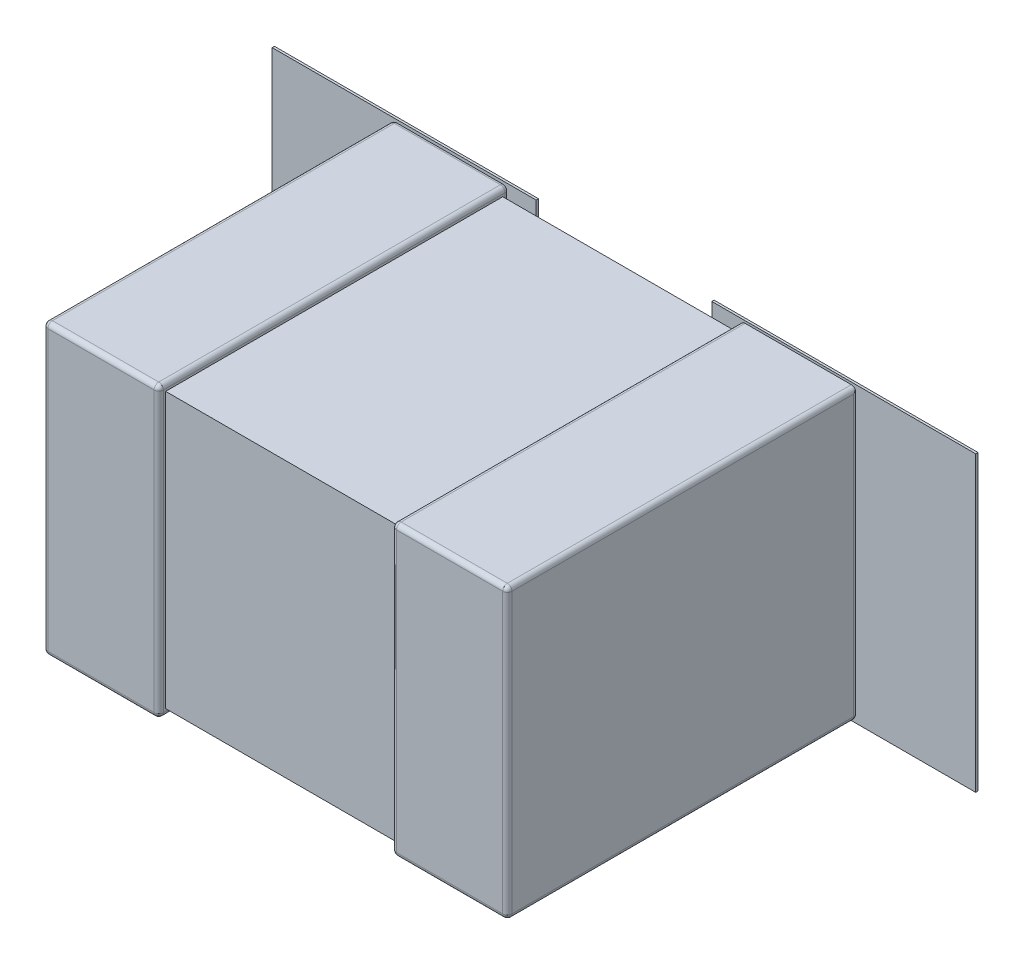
ISO-10303-21;
HEADER;
FILE_DESCRIPTION(('STEP AP214'),'2;1');
FILE_NAME('part.step','',(''),(''),'','','');
FILE_SCHEMA(('AUTOMOTIVE_DESIGN { 1 0 10303 214 1 1 1 1 }'));
ENDSEC;
DATA;
#1=APPLICATION_CONTEXT('core data for automotive mechanical design processes');
#2=APPLICATION_PROTOCOL_DEFINITION('international standard','automotive_design',2000,#1);
#3=PRODUCT_CONTEXT('',#1,'mechanical');
#4=PRODUCT('Part','Part','',(#3));
#5=PRODUCT_RELATED_PRODUCT_CATEGORY('part','',(#4));
#6=PRODUCT_DEFINITION_FORMATION('','',#4);
#7=PRODUCT_DEFINITION_CONTEXT('part definition',#1,'design');
#8=PRODUCT_DEFINITION('design','',#6,#7);
#9=PRODUCT_DEFINITION_SHAPE('','',#8);
#10=(LENGTH_UNIT() NAMED_UNIT(*) SI_UNIT(.MILLI.,.METRE.));
#11=(NAMED_UNIT(*) PLANE_ANGLE_UNIT() SI_UNIT($,.RADIAN.));
#12=(NAMED_UNIT(*) SI_UNIT($,.STERADIAN.) SOLID_ANGLE_UNIT());
#13=UNCERTAINTY_MEASURE_WITH_UNIT(LENGTH_MEASURE(1.E-05),#10,'distance_accuracy_value','');
#14=(GEOMETRIC_REPRESENTATION_CONTEXT(3) GLOBAL_UNCERTAINTY_ASSIGNED_CONTEXT((#13)) GLOBAL_UNIT_ASSIGNED_CONTEXT((#10,
#11,#12)) REPRESENTATION_CONTEXT('',''));
#15=CARTESIAN_POINT('',(0.,0.,0.));
#16=DIRECTION('',(0.,0.,1.));
#17=DIRECTION('',(1.,0.,0.));
#18=AXIS2_PLACEMENT_3D('',#15,#16,#17);
#19=CARTESIAN_POINT('',(0.,0.,0.0762));
#20=DIRECTION('',(0.,0.,1.));
#21=DIRECTION('',(1.,0.,0.));
#22=AXIS2_PLACEMENT_3D('',#19,#20,#21);
#23=PLANE('',#22);
#24=DIRECTION('',(1.,0.,0.));
#25=VECTOR('',#24,1.);
#26=CARTESIAN_POINT('',(-1.5235,-0.635,0.0762));
#27=LINE('',#26,#25);
#28=CARTESIAN_POINT('',(-1.5235,-0.635,0.0762));
#29=VERTEX_POINT('',#28);
#30=CARTESIAN_POINT('',(-0.380500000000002,-0.635,0.0762));
#31=VERTEX_POINT('',#30);
#32=EDGE_CURVE('E917',#29,#31,#27,.T.);
#33=ORIENTED_EDGE('',*,*,#32,.F.);
#34=DIRECTION('',(0.,1.,0.));
#35=VECTOR('',#34,1.);
#36=CARTESIAN_POINT('',(-1.5235,0.635,0.0762));
#37=LINE('',#36,#35);
#38=CARTESIAN_POINT('',(-1.5235,0.635,0.0762));
#39=VERTEX_POINT('',#38);
#40=EDGE_CURVE('E86',#39,#29,#37,.F.);
#41=ORIENTED_EDGE('',*,*,#40,.F.);
#42=DIRECTION('',(1.,0.,0.));
#43=VECTOR('',#42,1.);
#44=CARTESIAN_POINT('',(-0.380500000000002,0.635,0.0762));
#45=LINE('',#44,#43);
#46=CARTESIAN_POINT('',(-0.380500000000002,0.635,0.0762));
#47=VERTEX_POINT('',#46);
#48=EDGE_CURVE('E415',#47,#39,#45,.F.);
#49=ORIENTED_EDGE('',*,*,#48,.F.);
#50=DIRECTION('',(0.,1.,0.));
#51=VECTOR('',#50,1.);
#52=CARTESIAN_POINT('',(-0.380500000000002,-0.635,0.0762));
#53=LINE('',#52,#51);
#54=EDGE_CURVE('E924',#31,#47,#53,.T.);
#55=ORIENTED_EDGE('',*,*,#54,.F.);
#56=EDGE_LOOP('',(#33,#41,#49,#55));
#57=FACE_BOUND('',#56,.T.);
#58=ADVANCED_FACE('F16',(#57),#23,.F.);
#59=CARTESIAN_POINT('',(-0.98495100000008,0.60496700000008,1.57613600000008));
#60=DIRECTION('',(-0.707106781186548,0.,0.707106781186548));
#61=DIRECTION('',(0.,1.,0.));
#62=AXIS2_PLACEMENT_3D('',#59,#60,#61);
#63=SPHERICAL_SURFACE('',#62,0.0199999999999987);
#64=CARTESIAN_POINT('',(-0.98495100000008,0.60496700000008,1.57613600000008));
#65=DIRECTION('',(0.,-1.,0.));
#66=DIRECTION('',(0.,0.,-1.));
#67=AXIS2_PLACEMENT_3D('',#64,#65,#66);
#68=CIRCLE('',#67,0.0199999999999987);
#69=CARTESIAN_POINT('',(-0.98495100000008,0.60496700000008,1.59613600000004));
#70=VERTEX_POINT('',#69);
#71=CARTESIAN_POINT('',(-0.99909313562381,0.60496700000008,1.59027813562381));
#72=VERTEX_POINT('',#71);
#73=EDGE_CURVE('E248',#70,#72,#68,.T.);
#74=ORIENTED_EDGE('',*,*,#73,.F.);
#75=CARTESIAN_POINT('',(-0.98495100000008,0.60496700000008,1.57613600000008));
#76=DIRECTION('',(-1.,0.,0.));
#77=DIRECTION('',(0.,0.,1.));
#78=AXIS2_PLACEMENT_3D('',#75,#76,#77);
#79=CIRCLE('',#78,0.0199999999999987);
#80=CARTESIAN_POINT('',(-0.98495100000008,0.624967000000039,1.57613600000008));
#81=VERTEX_POINT('',#80);
#82=EDGE_CURVE('E251',#81,#70,#79,.F.);
#83=ORIENTED_EDGE('',*,*,#82,.F.);
#84=CARTESIAN_POINT('',(-0.98495100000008,0.60496700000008,1.57613600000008));
#85=DIRECTION('',(0.,0.,-1.));
#86=DIRECTION('',(-1.,0.,0.));
#87=AXIS2_PLACEMENT_3D('',#84,#85,#86);
#88=CIRCLE('',#87,0.0199999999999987);
#89=CARTESIAN_POINT('',(-1.00495100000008,0.60496700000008,1.57613600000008));
#90=VERTEX_POINT('',#89);
#91=EDGE_CURVE('E19',#90,#81,#88,.T.);
#92=ORIENTED_EDGE('',*,*,#91,.F.);
#93=CARTESIAN_POINT('',(-0.98495100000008,0.60496700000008,1.57613600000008));
#94=DIRECTION('',(0.,-1.,0.));
#95=DIRECTION('',(0.,0.,-1.));
#96=AXIS2_PLACEMENT_3D('',#93,#94,#95);
#97=CIRCLE('',#96,0.0199999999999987);
#98=EDGE_CURVE('E253',#72,#90,#97,.T.);
#99=ORIENTED_EDGE('',*,*,#98,.F.);
#100=EDGE_LOOP('',(#74,#83,#92,#99));
#101=FACE_BOUND('',#100,.T.);
#102=ADVANCED_FACE('F250',(#101),#63,.T.);
#103=CARTESIAN_POINT('',(-1.004951,0.624967,0.0762));
#104=DIRECTION('',(-1.,0.,0.));
#105=DIRECTION('',(0.,0.,1.));
#106=AXIS2_PLACEMENT_3D('',#103,#104,#105);
#107=PLANE('',#106);
#108=DIRECTION('',(0.,1.,0.));
#109=VECTOR('',#108,1.);
#110=CARTESIAN_POINT('',(-1.00495100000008,-2.43846719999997,0.0961999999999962));
#111=LINE('',#110,#109);
#112=CARTESIAN_POINT('',(-1.00495100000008,-0.60496700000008,0.0961999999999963));
#113=VERTEX_POINT('',#112);
#114=CARTESIAN_POINT('',(-1.00495100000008,0.60496700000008,0.0961999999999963));
#115=VERTEX_POINT('',#114);
#116=EDGE_CURVE('E414',#113,#115,#111,.T.);
#117=ORIENTED_EDGE('',*,*,#116,.F.);
#118=DIRECTION('',(0.,0.,-1.));
#119=VECTOR('',#118,1.);
#120=CARTESIAN_POINT('',(-1.00495100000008,-0.60496700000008,3.5775245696));
#121=LINE('',#120,#119);
#122=CARTESIAN_POINT('',(-1.00495100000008,-0.60496700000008,1.57613600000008));
#123=VERTEX_POINT('',#122);
#124=EDGE_CURVE('E457',#123,#113,#121,.T.);
#125=ORIENTED_EDGE('',*,*,#124,.F.);
#126=DIRECTION('',(0.,-1.,0.));
#127=VECTOR('',#126,1.);
#128=CARTESIAN_POINT('',(-1.00495100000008,2.43846719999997,1.57613600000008));
#129=LINE('',#128,#127);
#130=EDGE_CURVE('E453',#90,#123,#129,.T.);
#131=ORIENTED_EDGE('',*,*,#130,.F.);
#132=DIRECTION('',(0.,0.,-1.));
#133=VECTOR('',#132,1.);
#134=CARTESIAN_POINT('',(-1.00495100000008,0.60496700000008,3.5775245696));
#135=LINE('',#134,#133);
#136=EDGE_CURVE('E765',#115,#90,#135,.F.);
#137=ORIENTED_EDGE('',*,*,#136,.F.);
#138=EDGE_LOOP('',(#117,#125,#131,#137));
#139=FACE_BOUND('',#138,.T.);
#140=ADVANCED_FACE('F447',(#139),#107,.T.);
#141=CARTESIAN_POINT('',(-0.98495100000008,-0.60496700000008,1.57613600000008));
#142=DIRECTION('',(-0.707106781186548,-0.707106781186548,0.));
#143=DIRECTION('',(0.,0.,1.));
#144=AXIS2_PLACEMENT_3D('',#141,#142,#143);
#145=SPHERICAL_SURFACE('',#144,0.0199999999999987);
#146=CARTESIAN_POINT('',(-0.98495100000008,-0.60496700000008,1.57613600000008));
#147=DIRECTION('',(0.,0.,-1.));
#148=DIRECTION('',(-1.,0.,0.));
#149=AXIS2_PLACEMENT_3D('',#146,#147,#148);
#150=CIRCLE('',#149,0.0199999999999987);
#151=CARTESIAN_POINT('',(-0.99909313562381,-0.61910913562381,1.57613600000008));
#152=VERTEX_POINT('',#151);
#153=EDGE_CURVE('E34',#152,#123,#150,.T.);
#154=ORIENTED_EDGE('',*,*,#153,.F.);
#155=CARTESIAN_POINT('',(-0.98495100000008,-0.60496700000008,1.57613600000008));
#156=DIRECTION('',(0.,0.,-1.));
#157=DIRECTION('',(-1.,0.,0.));
#158=AXIS2_PLACEMENT_3D('',#155,#156,#157);
#159=CIRCLE('',#158,0.0199999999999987);
#160=CARTESIAN_POINT('',(-0.98495100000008,-0.624967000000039,1.57613600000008));
#161=VERTEX_POINT('',#160);
#162=EDGE_CURVE('E405',#161,#152,#159,.T.);
#163=ORIENTED_EDGE('',*,*,#162,.F.);
#164=CARTESIAN_POINT('',(-0.98495100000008,-0.60496700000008,1.57613600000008));
#165=DIRECTION('',(1.,0.,0.));
#166=DIRECTION('',(0.,0.,-1.));
#167=AXIS2_PLACEMENT_3D('',#164,#165,#166);
#168=CIRCLE('',#167,0.0199999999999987);
#169=CARTESIAN_POINT('',(-0.98495100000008,-0.60496700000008,1.59613600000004));
#170=VERTEX_POINT('',#169);
#171=EDGE_CURVE('E674',#170,#161,#168,.T.);
#172=ORIENTED_EDGE('',*,*,#171,.F.);
#173=CARTESIAN_POINT('',(-0.98495100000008,-0.60496700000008,1.57613600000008));
#174=DIRECTION('',(0.,-1.,0.));
#175=DIRECTION('',(0.,0.,-1.));
#176=AXIS2_PLACEMENT_3D('',#173,#174,#175);
#177=CIRCLE('',#176,0.0199999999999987);
#178=EDGE_CURVE('E271',#123,#170,#177,.F.);
#179=ORIENTED_EDGE('',*,*,#178,.F.);
#180=EDGE_LOOP('',(#154,#163,#172,#179));
#181=FACE_BOUND('',#180,.T.);
#182=ADVANCED_FACE('F442',(#181),#145,.T.);
#183=CARTESIAN_POINT('',(-0.98495100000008,0.60496700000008,3.5775245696));
#184=DIRECTION('',(0.,0.,-1.));
#185=DIRECTION('',(-1.,0.,0.));
#186=AXIS2_PLACEMENT_3D('',#183,#184,#185);
#187=CYLINDRICAL_SURFACE('',#186,0.0199999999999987);
#188=ORIENTED_EDGE('',*,*,#91,.T.);
#189=DIRECTION('',(0.,0.,1.));
#190=VECTOR('',#189,1.);
#191=CARTESIAN_POINT('',(-0.98495100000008,0.624967,0.0762));
#192=LINE('',#191,#190);
#193=CARTESIAN_POINT('',(-0.98495100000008,0.624967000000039,0.096199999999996));
#194=VERTEX_POINT('',#193);
#195=EDGE_CURVE('E451',#194,#81,#192,.T.);
#196=ORIENTED_EDGE('',*,*,#195,.F.);
#197=CARTESIAN_POINT('',(-0.98495100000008,0.60496700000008,0.0961999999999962));
#198=DIRECTION('',(0.,0.,-1.));
#199=DIRECTION('',(-0.707106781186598,0.707106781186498,0.));
#200=AXIS2_PLACEMENT_3D('',#197,#198,#199);
#201=CIRCLE('',#200,0.0199999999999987);
#202=CARTESIAN_POINT('',(-0.999093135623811,0.619109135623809,0.0961999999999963));
#203=VERTEX_POINT('',#202);
#204=EDGE_CURVE('E407',#203,#194,#201,.T.);
#205=ORIENTED_EDGE('',*,*,#204,.F.);
#206=CARTESIAN_POINT('',(-0.98495100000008,0.60496700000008,0.0961999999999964));
#207=DIRECTION('',(0.,0.,-1.));
#208=DIRECTION('',(-1.,0.,0.));
#209=AXIS2_PLACEMENT_3D('',#206,#207,#208);
#210=CIRCLE('',#209,0.0199999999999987);
#211=EDGE_CURVE('E410',#115,#203,#210,.T.);
#212=ORIENTED_EDGE('',*,*,#211,.F.);
#213=ORIENTED_EDGE('',*,*,#136,.T.);
#214=EDGE_LOOP('',(#188,#196,#205,#212,#213));
#215=FACE_BOUND('',#214,.T.);
#216=ADVANCED_FACE('F439',(#215),#187,.T.);
#217=CARTESIAN_POINT('',(-1.5235,0.635,0.0762));
#218=DIRECTION('',(-1.,0.,0.));
#219=DIRECTION('',(0.,0.,1.));
#220=AXIS2_PLACEMENT_3D('',#217,#218,#219);
#221=PLANE('',#220);
#222=DIRECTION('',(0.,0.,1.));
#223=VECTOR('',#222,1.);
#224=CARTESIAN_POINT('',(-1.5235,0.635,0.0762));
#225=LINE('',#224,#223);
#226=CARTESIAN_POINT('',(-1.5235,0.635,0.0862000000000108));
#227=VERTEX_POINT('',#226);
#228=EDGE_CURVE('E921',#39,#227,#225,.T.);
#229=ORIENTED_EDGE('',*,*,#228,.F.);
#230=ORIENTED_EDGE('',*,*,#40,.T.);
#231=DIRECTION('',(0.,0.,-1.));
#232=VECTOR('',#231,1.);
#233=CARTESIAN_POINT('',(-1.5235,-0.635,0.0762));
#234=LINE('',#233,#232);
#235=CARTESIAN_POINT('',(-1.5235,-0.635,0.0862000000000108));
#236=VERTEX_POINT('',#235);
#237=EDGE_CURVE('E919',#236,#29,#234,.T.);
#238=ORIENTED_EDGE('',*,*,#237,.F.);
#239=DIRECTION('',(0.,1.,0.));
#240=VECTOR('',#239,1.);
#241=CARTESIAN_POINT('',(-1.5235,0.,0.0862000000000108));
#242=LINE('',#241,#240);
#243=EDGE_CURVE('E350',#227,#236,#242,.F.);
#244=ORIENTED_EDGE('',*,*,#243,.F.);
#245=EDGE_LOOP('',(#229,#230,#238,#244));
#246=FACE_BOUND('',#245,.T.);
#247=ADVANCED_FACE('F435',(#246),#221,.T.);
#248=CARTESIAN_POINT('',(-1.5235,-0.635,0.0762));
#249=DIRECTION('',(0.,-1.,0.));
#250=DIRECTION('',(0.,0.,-1.));
#251=AXIS2_PLACEMENT_3D('',#248,#249,#250);
#252=PLANE('',#251);
#253=ORIENTED_EDGE('',*,*,#237,.T.);
#254=ORIENTED_EDGE('',*,*,#32,.T.);
#255=DIRECTION('',(0.,0.,-1.));
#256=VECTOR('',#255,1.);
#257=CARTESIAN_POINT('',(-0.380500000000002,-0.635,0.0762));
#258=LINE('',#257,#256);
#259=CARTESIAN_POINT('',(-0.380500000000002,-0.635,0.0862000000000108));
#260=VERTEX_POINT('',#259);
#261=EDGE_CURVE('E928',#260,#31,#258,.T.);
#262=ORIENTED_EDGE('',*,*,#261,.F.);
#263=DIRECTION('',(1.,0.,0.));
#264=VECTOR('',#263,1.);
#265=CARTESIAN_POINT('',(0.,-0.635,0.0862000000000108));
#266=LINE('',#265,#264);
#267=EDGE_CURVE('E347',#236,#260,#266,.T.);
#268=ORIENTED_EDGE('',*,*,#267,.F.);
#269=EDGE_LOOP('',(#253,#254,#262,#268));
#270=FACE_BOUND('',#269,.T.);
#271=ADVANCED_FACE('F431',(#270),#252,.T.);
#272=CARTESIAN_POINT('',(-0.380500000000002,-0.635,0.0762));
#273=DIRECTION('',(1.,0.,0.));
#274=DIRECTION('',(0.,0.,-1.));
#275=AXIS2_PLACEMENT_3D('',#272,#273,#274);
#276=PLANE('',#275);
#277=ORIENTED_EDGE('',*,*,#261,.T.);
#278=ORIENTED_EDGE('',*,*,#54,.T.);
#279=DIRECTION('',(0.,0.,1.));
#280=VECTOR('',#279,1.);
#281=CARTESIAN_POINT('',(-0.380500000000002,0.635,0.0762));
#282=LINE('',#281,#280);
#283=CARTESIAN_POINT('',(-0.380500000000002,0.635,0.0862000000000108));
#284=VERTEX_POINT('',#283);
#285=EDGE_CURVE('E923',#284,#47,#282,.F.);
#286=ORIENTED_EDGE('',*,*,#285,.F.);
#287=DIRECTION('',(0.,1.,0.));
#288=VECTOR('',#287,1.);
#289=CARTESIAN_POINT('',(-0.380500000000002,0.,0.0862000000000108));
#290=LINE('',#289,#288);
#291=EDGE_CURVE('E344',#260,#284,#290,.T.);
#292=ORIENTED_EDGE('',*,*,#291,.F.);
#293=EDGE_LOOP('',(#277,#278,#286,#292));
#294=FACE_BOUND('',#293,.T.);
#295=ADVANCED_FACE('F427',(#294),#276,.T.);
#296=CARTESIAN_POINT('',(-0.380500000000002,0.635,0.0762));
#297=DIRECTION('',(0.,1.,0.));
#298=DIRECTION('',(0.,0.,1.));
#299=AXIS2_PLACEMENT_3D('',#296,#297,#298);
#300=PLANE('',#299);
#301=ORIENTED_EDGE('',*,*,#285,.T.);
#302=ORIENTED_EDGE('',*,*,#48,.T.);
#303=ORIENTED_EDGE('',*,*,#228,.T.);
#304=DIRECTION('',(1.,0.,0.));
#305=VECTOR('',#304,1.);
#306=CARTESIAN_POINT('',(0.,0.635,0.0862000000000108));
#307=LINE('',#306,#305);
#308=EDGE_CURVE('E341',#284,#227,#307,.F.);
#309=ORIENTED_EDGE('',*,*,#308,.F.);
#310=EDGE_LOOP('',(#301,#302,#303,#309));
#311=FACE_BOUND('',#310,.T.);
#312=ADVANCED_FACE('F423',(#311),#300,.T.);
#313=CARTESIAN_POINT('',(-0.98495100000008,-0.60496700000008,0.0961999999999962));
#314=DIRECTION('',(-0.707106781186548,0.,-0.707106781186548));
#315=DIRECTION('',(0.,-1.,0.));
#316=AXIS2_PLACEMENT_3D('',#313,#314,#315);
#317=SPHERICAL_SURFACE('',#316,0.0199999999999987);
#318=CARTESIAN_POINT('',(-0.98495100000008,-0.60496700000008,0.0961999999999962));
#319=DIRECTION('',(0.,1.,0.));
#320=DIRECTION('',(0.,0.,1.));
#321=AXIS2_PLACEMENT_3D('',#318,#319,#320);
#322=CIRCLE('',#321,0.0199999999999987);
#323=CARTESIAN_POINT('',(-1.00227150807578,-0.60496700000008,0.0862000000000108));
#324=VERTEX_POINT('',#323);
#325=EDGE_CURVE('E411',#324,#113,#322,.T.);
#326=ORIENTED_EDGE('',*,*,#325,.F.);
#327=CARTESIAN_POINT('',(-0.98495100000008,-0.622287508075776,0.0862000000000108));
#328=CARTESIAN_POINT('',(-0.986903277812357,-0.622300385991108,0.0862000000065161));
#329=CARTESIAN_POINT('',(-0.988847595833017,-0.621959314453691,0.0862000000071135));
#330=CARTESIAN_POINT('',(-0.992520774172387,-0.620662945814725,0.0862000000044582));
#331=CARTESIAN_POINT('',(-0.994249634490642,-0.619707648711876,0.0862000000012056));
#332=CARTESIAN_POINT('',(-0.997292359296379,-0.617276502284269,0.086199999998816));
#333=CARTESIAN_POINT('',(-0.998606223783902,-0.615800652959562,0.0861999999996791));
#334=CARTESIAN_POINT('',(-1.00066964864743,-0.612495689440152,0.0862000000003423));
#335=CARTESIAN_POINT('',(-1.00141920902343,-0.610666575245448,0.0862000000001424));
#336=CARTESIAN_POINT('',(-1.00213177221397,-0.607521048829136,0.0861999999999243));
#337=CARTESIAN_POINT('',(-1.00227616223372,-0.606243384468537,0.0861999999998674));
#338=CARTESIAN_POINT('',(-1.00227150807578,-0.60496700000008,0.0862000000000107));
#339=B_SPLINE_CURVE_WITH_KNOTS('',3,(#327,#328,#329,#330,#331,#332,#333,#334,#335,#336,#337,
#338),.UNSPECIFIED.,.F.,.F.,(4,2,2,2,2,4),(0.,0.00581573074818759,0.0116314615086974,
0.0174471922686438,0.0232629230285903,0.0270884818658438),.UNSPECIFIED.);
#340=CARTESIAN_POINT('',(-0.98495100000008,-0.62228750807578,0.0862000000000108));
#341=VERTEX_POINT('',#340);
#342=EDGE_CURVE('E337',#341,#324,#339,.T.);
#343=ORIENTED_EDGE('',*,*,#342,.F.);
#344=CARTESIAN_POINT('',(-0.98495100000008,-0.60496700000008,0.0961999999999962));
#345=DIRECTION('',(-1.,0.,0.));
#346=DIRECTION('',(0.,0.,1.));
#347=AXIS2_PLACEMENT_3D('',#344,#345,#346);
#348=CIRCLE('',#347,0.0199999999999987);
#349=CARTESIAN_POINT('',(-0.98495100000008,-0.624967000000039,0.0961999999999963));
#350=VERTEX_POINT('',#349);
#351=EDGE_CURVE('E264',#350,#341,#348,.F.);
#352=ORIENTED_EDGE('',*,*,#351,.F.);
#353=CARTESIAN_POINT('',(-0.98495100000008,-0.60496700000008,0.0961999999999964));
#354=DIRECTION('',(0.,0.,-1.));
#355=DIRECTION('',(-1.,0.,0.));
#356=AXIS2_PLACEMENT_3D('',#353,#354,#355);
#357=CIRCLE('',#356,0.0199999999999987);
#358=EDGE_CURVE('E745',#113,#350,#357,.F.);
#359=ORIENTED_EDGE('',*,*,#358,.F.);
#360=EDGE_LOOP('',(#326,#343,#352,#359));
#361=FACE_BOUND('',#360,.T.);
#362=ADVANCED_FACE('F419',(#361),#317,.T.);
#363=CARTESIAN_POINT('',(-0.98495100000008,-2.43846719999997,0.0961999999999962));
#364=DIRECTION('',(0.,1.,0.));
#365=DIRECTION('',(0.,0.,1.));
#366=AXIS2_PLACEMENT_3D('',#363,#364,#365);
#367=CYLINDRICAL_SURFACE('',#366,0.0199999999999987);
#368=CARTESIAN_POINT('',(-0.98495100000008,0.60496700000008,0.0961999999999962));
#369=DIRECTION('',(0.,1.,0.));
#370=DIRECTION('',(0.,0.,1.));
#371=AXIS2_PLACEMENT_3D('',#368,#369,#370);
#372=CIRCLE('',#371,0.0199999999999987);
#373=CARTESIAN_POINT('',(-1.00227150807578,0.60496700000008,0.0862000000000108));
#374=VERTEX_POINT('',#373);
#375=EDGE_CURVE('E757',#374,#115,#372,.T.);
#376=ORIENTED_EDGE('',*,*,#375,.F.);
#377=DIRECTION('',(0.,1.,0.));
#378=VECTOR('',#377,1.);
#379=CARTESIAN_POINT('',(-1.00227150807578,0.,0.0862000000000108));
#380=LINE('',#379,#378);
#381=EDGE_CURVE('E334',#324,#374,#380,.T.);
#382=ORIENTED_EDGE('',*,*,#381,.F.);
#383=ORIENTED_EDGE('',*,*,#325,.T.);
#384=ORIENTED_EDGE('',*,*,#116,.T.);
#385=EDGE_LOOP('',(#376,#382,#383,#384));
#386=FACE_BOUND('',#385,.T.);
#387=ADVANCED_FACE('F399',(#386),#367,.T.);
#388=CARTESIAN_POINT('',(-0.98495100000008,0.60496700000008,0.0961999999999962));
#389=DIRECTION('',(-0.707106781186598,0.707106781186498,0.));
#390=DIRECTION('',(0.,0.,-1.));
#391=AXIS2_PLACEMENT_3D('',#388,#389,#390);
#392=SPHERICAL_SURFACE('',#391,0.0199999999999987);
#393=CARTESIAN_POINT('',(-0.98495100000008,0.60496700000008,0.0961999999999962));
#394=DIRECTION('',(1.,0.,0.));
#395=DIRECTION('',(0.,0.,-1.));
#396=AXIS2_PLACEMENT_3D('',#393,#394,#395);
#397=CIRCLE('',#396,0.0199999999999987);
#398=CARTESIAN_POINT('',(-0.98495100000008,0.62228750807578,0.0862000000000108));
#399=VERTEX_POINT('',#398);
#400=EDGE_CURVE('E409',#399,#194,#397,.T.);
#401=ORIENTED_EDGE('',*,*,#400,.F.);
#402=CARTESIAN_POINT('',(-1.00227150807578,0.60496700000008,0.0862000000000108));
#403=CARTESIAN_POINT('',(-1.00228438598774,0.60691927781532,0.0862000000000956));
#404=CARTESIAN_POINT('',(-1.00194331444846,0.608863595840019,0.0862000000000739));
#405=CARTESIAN_POINT('',(-1.00064694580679,0.612536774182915,0.0862000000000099));
#406=CARTESIAN_POINT('',(-0.999691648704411,0.614265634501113,0.0861999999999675));
#407=CARTESIAN_POINT('',(-0.99726050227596,0.617308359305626,0.0862000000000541));
#408=CARTESIAN_POINT('',(-0.995784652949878,0.618622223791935,0.086200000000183));
#409=CARTESIAN_POINT('',(-0.992479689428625,0.620685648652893,0.0862000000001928));
#410=CARTESIAN_POINT('',(-0.990650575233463,0.621435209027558,0.0862000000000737));
#411=CARTESIAN_POINT('',(-0.987505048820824,0.622147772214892,0.0861999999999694));
#412=CARTESIAN_POINT('',(-0.986227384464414,0.622292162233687,0.0861999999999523));
#413=CARTESIAN_POINT('',(-0.98495100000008,0.622287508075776,0.0862000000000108));
#414=B_SPLINE_CURVE_WITH_KNOTS('',3,(#402,#403,#404,#405,#406,#407,#408,#409,#410,#411,#412,
#413),.UNSPECIFIED.,.F.,.F.,(4,2,2,2,2,4),(0.,0.00581573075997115,0.0116314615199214,
0.0174471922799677,0.0232629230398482,0.0270884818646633),.UNSPECIFIED.);
#415=EDGE_CURVE('E333',#374,#399,#414,.T.);
#416=ORIENTED_EDGE('',*,*,#415,.F.);
#417=ORIENTED_EDGE('',*,*,#375,.T.);
#418=ORIENTED_EDGE('',*,*,#211,.T.);
#419=ORIENTED_EDGE('',*,*,#204,.T.);
#420=EDGE_LOOP('',(#401,#416,#417,#418,#419));
#421=FACE_BOUND('',#420,.T.);
#422=ADVANCED_FACE('F392',(#421),#392,.T.);
#423=CARTESIAN_POINT('',(-5.4955692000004,0.60496700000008,0.0961999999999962));
#424=DIRECTION('',(1.,0.,0.));
#425=DIRECTION('',(0.,0.,-1.));
#426=AXIS2_PLACEMENT_3D('',#423,#424,#425);
#427=CYLINDRICAL_SURFACE('',#426,0.0199999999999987);
#428=CARTESIAN_POINT('',(-0.524950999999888,0.60496700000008,0.0961999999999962));
#429=DIRECTION('',(1.,0.,0.));
#430=DIRECTION('',(0.,0.,-1.));
#431=AXIS2_PLACEMENT_3D('',#428,#429,#430);
#432=CIRCLE('',#431,0.0199999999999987);
#433=CARTESIAN_POINT('',(-0.524950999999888,0.62228750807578,0.0862000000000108));
#434=VERTEX_POINT('',#433);
#435=CARTESIAN_POINT('',(-0.524950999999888,0.624967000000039,0.0961999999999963));
#436=VERTEX_POINT('',#435);
#437=EDGE_CURVE('E353',#434,#436,#432,.T.);
#438=ORIENTED_EDGE('',*,*,#437,.F.);
#439=DIRECTION('',(1.,0.,0.));
#440=VECTOR('',#439,1.);
#441=CARTESIAN_POINT('',(0.,0.622287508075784,0.0862000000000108));
#442=LINE('',#441,#440);
#443=EDGE_CURVE('E329',#399,#434,#442,.T.);
#444=ORIENTED_EDGE('',*,*,#443,.F.);
#445=ORIENTED_EDGE('',*,*,#400,.T.);
#446=DIRECTION('',(1.,0.,0.));
#447=VECTOR('',#446,1.);
#448=CARTESIAN_POINT('',(1.004951,0.624967,0.0961999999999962));
#449=LINE('',#448,#447);
#450=EDGE_CURVE('E673',#436,#194,#449,.F.);
#451=ORIENTED_EDGE('',*,*,#450,.F.);
#452=EDGE_LOOP('',(#438,#444,#445,#451));
#453=FACE_BOUND('',#452,.T.);
#454=ADVANCED_FACE('F398',(#453),#427,.T.);
#455=CARTESIAN_POINT('',(-0.98495100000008,-0.60496700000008,3.5775245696));
#456=DIRECTION('',(0.,0.,-1.));
#457=DIRECTION('',(-1.,0.,0.));
#458=AXIS2_PLACEMENT_3D('',#455,#456,#457);
#459=CYLINDRICAL_SURFACE('',#458,0.0199999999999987);
#460=ORIENTED_EDGE('',*,*,#153,.T.);
#461=ORIENTED_EDGE('',*,*,#124,.T.);
#462=ORIENTED_EDGE('',*,*,#358,.T.);
#463=DIRECTION('',(0.,0.,-1.));
#464=VECTOR('',#463,1.);
#465=CARTESIAN_POINT('',(-0.98495100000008,-0.624967,0.0762));
#466=LINE('',#465,#464);
#467=EDGE_CURVE('E323',#161,#350,#466,.T.);
#468=ORIENTED_EDGE('',*,*,#467,.F.);
#469=ORIENTED_EDGE('',*,*,#162,.T.);
#470=EDGE_LOOP('',(#460,#461,#462,#468,#469));
#471=FACE_BOUND('',#470,.T.);
#472=ADVANCED_FACE('F742',(#471),#459,.T.);
#473=CARTESIAN_POINT('',(5.4955692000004,-0.60496700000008,0.0961999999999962));
#474=DIRECTION('',(-1.,0.,0.));
#475=DIRECTION('',(0.,0.,1.));
#476=AXIS2_PLACEMENT_3D('',#473,#474,#475);
#477=CYLINDRICAL_SURFACE('',#476,0.0199999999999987);
#478=ORIENTED_EDGE('',*,*,#351,.T.);
#479=DIRECTION('',(1.,0.,0.));
#480=VECTOR('',#479,1.);
#481=CARTESIAN_POINT('',(0.,-0.622287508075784,0.0862000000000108));
#482=LINE('',#481,#480);
#483=CARTESIAN_POINT('',(-0.524950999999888,-0.62228750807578,0.0862000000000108));
#484=VERTEX_POINT('',#483);
#485=EDGE_CURVE('E338',#484,#341,#482,.F.);
#486=ORIENTED_EDGE('',*,*,#485,.F.);
#487=CARTESIAN_POINT('',(-0.524950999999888,-0.60496700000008,0.0961999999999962));
#488=DIRECTION('',(-1.,0.,0.));
#489=DIRECTION('',(0.,0.,1.));
#490=AXIS2_PLACEMENT_3D('',#487,#488,#489);
#491=CIRCLE('',#490,0.0199999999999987);
#492=CARTESIAN_POINT('',(-0.524950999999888,-0.624967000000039,0.0961999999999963));
#493=VERTEX_POINT('',#492);
#494=EDGE_CURVE('E380',#493,#484,#491,.F.);
#495=ORIENTED_EDGE('',*,*,#494,.F.);
#496=DIRECTION('',(1.,0.,0.));
#497=VECTOR('',#496,1.);
#498=CARTESIAN_POINT('',(-1.004951,-0.624967,0.0961999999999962));
#499=LINE('',#498,#497);
#500=EDGE_CURVE('E320',#350,#493,#499,.T.);
#501=ORIENTED_EDGE('',*,*,#500,.F.);
#502=EDGE_LOOP('',(#478,#486,#495,#501));
#503=FACE_BOUND('',#502,.T.);
#504=ADVANCED_FACE('F697',(#503),#477,.T.);
#505=CARTESIAN_POINT('',(5.4955692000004,0.60496700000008,1.57613600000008));
#506=DIRECTION('',(-1.,0.,0.));
#507=DIRECTION('',(0.,0.,1.));
#508=AXIS2_PLACEMENT_3D('',#505,#506,#507);
#509=CYLINDRICAL_SURFACE('',#508,0.0199999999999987);
#510=ORIENTED_EDGE('',*,*,#82,.T.);
#511=DIRECTION('',(1.,0.,0.));
#512=VECTOR('',#511,1.);
#513=CARTESIAN_POINT('',(0.,0.60496700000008,1.596136));
#514=LINE('',#513,#512);
#515=CARTESIAN_POINT('',(-0.524950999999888,0.60496700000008,1.59613600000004));
#516=VERTEX_POINT('',#515);
#517=EDGE_CURVE('E260',#516,#70,#514,.F.);
#518=ORIENTED_EDGE('',*,*,#517,.F.);
#519=CARTESIAN_POINT('',(-0.524950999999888,0.60496700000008,1.57613600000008));
#520=DIRECTION('',(-1.,0.,0.));
#521=DIRECTION('',(0.,0.,1.));
#522=AXIS2_PLACEMENT_3D('',#519,#520,#521);
#523=CIRCLE('',#522,0.0199999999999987);
#524=CARTESIAN_POINT('',(-0.524950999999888,0.624967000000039,1.57613600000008));
#525=VERTEX_POINT('',#524);
#526=EDGE_CURVE('E282',#525,#516,#523,.F.);
#527=ORIENTED_EDGE('',*,*,#526,.F.);
#528=DIRECTION('',(1.,0.,0.));
#529=VECTOR('',#528,1.);
#530=CARTESIAN_POINT('',(1.004951,0.624967,1.57613600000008));
#531=LINE('',#530,#529);
#532=EDGE_CURVE('E263',#81,#525,#531,.T.);
#533=ORIENTED_EDGE('',*,*,#532,.F.);
#534=EDGE_LOOP('',(#510,#518,#527,#533));
#535=FACE_BOUND('',#534,.T.);
#536=ADVANCED_FACE('F258',(#535),#509,.T.);
#537=CARTESIAN_POINT('',(-0.98495100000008,2.43846719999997,1.57613600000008));
#538=DIRECTION('',(0.,-1.,0.));
#539=DIRECTION('',(0.,0.,-1.));
#540=AXIS2_PLACEMENT_3D('',#537,#538,#539);
#541=CYLINDRICAL_SURFACE('',#540,0.0199999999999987);
#542=ORIENTED_EDGE('',*,*,#178,.T.);
#543=DIRECTION('',(0.,1.,0.));
#544=VECTOR('',#543,1.);
#545=CARTESIAN_POINT('',(-0.98495100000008,0.,1.596136));
#546=LINE('',#545,#544);
#547=EDGE_CURVE('E268',#70,#170,#546,.F.);
#548=ORIENTED_EDGE('',*,*,#547,.F.);
#549=ORIENTED_EDGE('',*,*,#73,.T.);
#550=ORIENTED_EDGE('',*,*,#98,.T.);
#551=ORIENTED_EDGE('',*,*,#130,.T.);
#552=EDGE_LOOP('',(#542,#548,#549,#550,#551));
#553=FACE_BOUND('',#552,.T.);
#554=ADVANCED_FACE('F269',(#553),#541,.T.);
#555=CARTESIAN_POINT('',(-5.4955692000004,-0.60496700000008,1.57613600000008));
#556=DIRECTION('',(1.,0.,0.));
#557=DIRECTION('',(0.,0.,-1.));
#558=AXIS2_PLACEMENT_3D('',#555,#556,#557);
#559=CYLINDRICAL_SURFACE('',#558,0.0199999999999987);
#560=ORIENTED_EDGE('',*,*,#171,.T.);
#561=DIRECTION('',(1.,0.,0.));
#562=VECTOR('',#561,1.);
#563=CARTESIAN_POINT('',(-1.004951,-0.624967,1.57613600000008));
#564=LINE('',#563,#562);
#565=CARTESIAN_POINT('',(-0.524950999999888,-0.624967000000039,1.57613600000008));
#566=VERTEX_POINT('',#565);
#567=EDGE_CURVE('E318',#566,#161,#564,.F.);
#568=ORIENTED_EDGE('',*,*,#567,.F.);
#569=CARTESIAN_POINT('',(-0.524950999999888,-0.60496700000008,1.57613600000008));
#570=DIRECTION('',(1.,0.,0.));
#571=DIRECTION('',(0.,0.,-1.));
#572=AXIS2_PLACEMENT_3D('',#569,#570,#571);
#573=CIRCLE('',#572,0.0199999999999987);
#574=CARTESIAN_POINT('',(-0.524950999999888,-0.60496700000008,1.59613600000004));
#575=VERTEX_POINT('',#574);
#576=EDGE_CURVE('E284',#575,#566,#573,.T.);
#577=ORIENTED_EDGE('',*,*,#576,.F.);
#578=DIRECTION('',(1.,0.,0.));
#579=VECTOR('',#578,1.);
#580=CARTESIAN_POINT('',(0.,-0.60496700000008,1.596136));
#581=LINE('',#580,#579);
#582=EDGE_CURVE('E275',#170,#575,#581,.T.);
#583=ORIENTED_EDGE('',*,*,#582,.F.);
#584=EDGE_LOOP('',(#560,#568,#577,#583));
#585=FACE_BOUND('',#584,.T.);
#586=ADVANCED_FACE('F746',(#585),#559,.T.);
#587=CARTESIAN_POINT('',(1.004951,0.624967,0.0762));
#588=DIRECTION('',(0.,1.,0.));
#589=DIRECTION('',(0.,0.,1.));
#590=AXIS2_PLACEMENT_3D('',#587,#588,#589);
#591=PLANE('',#590);
#592=ORIENTED_EDGE('',*,*,#450,.T.);
#593=ORIENTED_EDGE('',*,*,#195,.T.);
#594=ORIENTED_EDGE('',*,*,#532,.T.);
#595=DIRECTION('',(0.,0.,-1.));
#596=VECTOR('',#595,1.);
#597=CARTESIAN_POINT('',(-0.524950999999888,0.624967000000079,3.5775245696));
#598=LINE('',#597,#596);
#599=EDGE_CURVE('E362',#436,#525,#598,.F.);
#600=ORIENTED_EDGE('',*,*,#599,.F.);
#601=EDGE_LOOP('',(#592,#593,#594,#600));
#602=FACE_BOUND('',#601,.T.);
#603=ADVANCED_FACE('F370',(#602),#591,.T.);
#604=CARTESIAN_POINT('',(-0.524950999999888,0.60496700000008,0.0961999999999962));
#605=DIRECTION('',(0.707106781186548,0.,-0.707106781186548));
#606=DIRECTION('',(0.,1.,0.));
#607=AXIS2_PLACEMENT_3D('',#604,#605,#606);
#608=SPHERICAL_SURFACE('',#607,0.0199999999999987);
#609=CARTESIAN_POINT('',(-0.524950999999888,0.60496700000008,0.0961999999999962));
#610=DIRECTION('',(0.,-1.,0.));
#611=DIRECTION('',(0.,0.,-1.));
#612=AXIS2_PLACEMENT_3D('',#609,#610,#611);
#613=CIRCLE('',#612,0.0199999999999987);
#614=CARTESIAN_POINT('',(-0.507630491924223,0.60496700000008,0.0861999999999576));
#615=VERTEX_POINT('',#614);
#616=CARTESIAN_POINT('',(-0.504950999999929,0.60496700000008,0.0961999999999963));
#617=VERTEX_POINT('',#616);
#618=EDGE_CURVE('E359',#615,#617,#613,.T.);
#619=ORIENTED_EDGE('',*,*,#618,.F.);
#620=CARTESIAN_POINT('',(-0.524950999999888,0.622287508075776,0.0862000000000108));
#621=CARTESIAN_POINT('',(-0.522998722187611,0.622300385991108,0.0862000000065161));
#622=CARTESIAN_POINT('',(-0.521054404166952,0.621959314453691,0.0862000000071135));
#623=CARTESIAN_POINT('',(-0.517381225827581,0.620662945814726,0.0862000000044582));
#624=CARTESIAN_POINT('',(-0.515652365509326,0.619707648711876,0.0862000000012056));
#625=CARTESIAN_POINT('',(-0.512609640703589,0.617276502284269,0.086199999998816));
#626=CARTESIAN_POINT('',(-0.511295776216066,0.615800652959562,0.0861999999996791));
#627=CARTESIAN_POINT('',(-0.509232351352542,0.612495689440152,0.0862000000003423));
#628=CARTESIAN_POINT('',(-0.508482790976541,0.610666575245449,0.0862000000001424));
#629=CARTESIAN_POINT('',(-0.507770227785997,0.607521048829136,0.0861999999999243));
#630=CARTESIAN_POINT('',(-0.507625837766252,0.606243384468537,0.0861999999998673));
#631=CARTESIAN_POINT('',(-0.507630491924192,0.60496700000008,0.0862000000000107));
#632=B_SPLINE_CURVE_WITH_KNOTS('',3,(#620,#621,#622,#623,#624,#625,#626,#627,#628,#629,#630,
#631),.UNSPECIFIED.,.F.,.F.,(4,2,2,2,2,4),(0.,0.00581573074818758,0.0116314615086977,
0.0174471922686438,0.0232629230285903,0.027088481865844),.UNSPECIFIED.);
#633=EDGE_CURVE('E332',#434,#615,#632,.T.);
#634=ORIENTED_EDGE('',*,*,#633,.F.);
#635=ORIENTED_EDGE('',*,*,#437,.T.);
#636=CARTESIAN_POINT('',(-0.524950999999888,0.60496700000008,0.0961999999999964));
#637=DIRECTION('',(0.,0.,-1.));
#638=DIRECTION('',(-1.,0.,0.));
#639=AXIS2_PLACEMENT_3D('',#636,#637,#638);
#640=CIRCLE('',#639,0.0199999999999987);
#641=EDGE_CURVE('E677',#617,#436,#640,.F.);
#642=ORIENTED_EDGE('',*,*,#641,.F.);
#643=EDGE_LOOP('',(#619,#634,#635,#642));
#644=FACE_BOUND('',#643,.T.);
#645=ADVANCED_FACE('F366',(#644),#608,.T.);
#646=CARTESIAN_POINT('',(0.,0.,0.0862000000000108));
#647=DIRECTION('',(0.,0.,1.));
#648=DIRECTION('',(1.,0.,0.));
#649=AXIS2_PLACEMENT_3D('',#646,#647,#648);
#650=PLANE('',#649);
#651=ORIENTED_EDGE('',*,*,#633,.T.);
#652=DIRECTION('',(0.,-1.,0.));
#653=VECTOR('',#652,1.);
#654=CARTESIAN_POINT('',(-0.507630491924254,2.43846719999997,0.0861999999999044));
#655=LINE('',#654,#653);
#656=CARTESIAN_POINT('',(-0.507630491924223,-0.60496700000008,0.0861999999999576));
#657=VERTEX_POINT('',#656);
#658=EDGE_CURVE('E354',#657,#615,#655,.F.);
#659=ORIENTED_EDGE('',*,*,#658,.F.);
#660=CARTESIAN_POINT('',(-0.524950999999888,-0.622287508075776,0.0862000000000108));
#661=CARTESIAN_POINT('',(-0.522998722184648,-0.622300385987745,0.08620000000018));
#662=CARTESIAN_POINT('',(-0.521054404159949,-0.621959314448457,0.0862000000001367));
#663=CARTESIAN_POINT('',(-0.517381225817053,-0.620662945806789,0.0862000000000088));
#664=CARTESIAN_POINT('',(-0.515652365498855,-0.619707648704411,0.0861999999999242));
#665=CARTESIAN_POINT('',(-0.512609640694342,-0.61727650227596,0.0862000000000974));
#666=CARTESIAN_POINT('',(-0.511295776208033,-0.615800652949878,0.0862000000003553));
#667=CARTESIAN_POINT('',(-0.509232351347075,-0.612495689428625,0.0862000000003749));
#668=CARTESIAN_POINT('',(-0.50848279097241,-0.610666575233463,0.0862000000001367));
#669=CARTESIAN_POINT('',(-0.507770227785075,-0.607521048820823,0.086199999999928));
#670=CARTESIAN_POINT('',(-0.507625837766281,-0.606243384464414,0.0861999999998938));
#671=CARTESIAN_POINT('',(-0.507630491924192,-0.60496700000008,0.0862000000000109));
#672=B_SPLINE_CURVE_WITH_KNOTS('',3,(#660,#661,#662,#663,#664,#665,#666,#667,#668,#669,#670,
#671),.UNSPECIFIED.,.F.,.F.,(4,2,2,2,2,4),(0.,0.00581573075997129,0.0116314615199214,
0.0174471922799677,0.0232629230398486,0.0270884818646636),.UNSPECIFIED.);
#673=EDGE_CURVE('E684',#484,#657,#672,.T.);
#674=ORIENTED_EDGE('',*,*,#673,.F.);
#675=ORIENTED_EDGE('',*,*,#485,.T.);
#676=ORIENTED_EDGE('',*,*,#342,.T.);
#677=ORIENTED_EDGE('',*,*,#381,.T.);
#678=ORIENTED_EDGE('',*,*,#415,.T.);
#679=ORIENTED_EDGE('',*,*,#443,.T.);
#680=EDGE_LOOP('',(#651,#659,#674,#675,#676,#677,#678,#679));
#681=FACE_BOUND('',#680,.T.);
#682=ORIENTED_EDGE('',*,*,#291,.T.);
#683=ORIENTED_EDGE('',*,*,#308,.T.);
#684=ORIENTED_EDGE('',*,*,#243,.T.);
#685=ORIENTED_EDGE('',*,*,#267,.T.);
#686=EDGE_LOOP('',(#682,#683,#684,#685));
#687=FACE_BOUND('',#686,.T.);
#688=ADVANCED_FACE('F310',(#681,#687),#650,.T.);
#689=CARTESIAN_POINT('',(-0.524950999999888,-0.60496700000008,0.0961999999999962));
#690=DIRECTION('',(0.707106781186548,-0.707106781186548,0.));
#691=DIRECTION('',(0.,0.,-1.));
#692=AXIS2_PLACEMENT_3D('',#689,#690,#691);
#693=SPHERICAL_SURFACE('',#692,0.0199999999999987);
#694=ORIENTED_EDGE('',*,*,#494,.T.);
#695=ORIENTED_EDGE('',*,*,#673,.T.);
#696=CARTESIAN_POINT('',(-0.524950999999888,-0.60496700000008,0.0961999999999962));
#697=DIRECTION('',(0.,-1.,0.));
#698=DIRECTION('',(0.,0.,-1.));
#699=AXIS2_PLACEMENT_3D('',#696,#697,#698);
#700=CIRCLE('',#699,0.0199999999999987);
#701=CARTESIAN_POINT('',(-0.504950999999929,-0.60496700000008,0.0961999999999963));
#702=VERTEX_POINT('',#701);
#703=EDGE_CURVE('E358',#702,#657,#700,.F.);
#704=ORIENTED_EDGE('',*,*,#703,.F.);
#705=CARTESIAN_POINT('',(-0.524950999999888,-0.60496700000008,0.0961999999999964));
#706=DIRECTION('',(0.,0.,1.));
#707=DIRECTION('',(1.,0.,0.));
#708=AXIS2_PLACEMENT_3D('',#705,#706,#707);
#709=CIRCLE('',#708,0.0199999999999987);
#710=CARTESIAN_POINT('',(-0.510808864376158,-0.61910913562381,0.0961999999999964));
#711=VERTEX_POINT('',#710);
#712=EDGE_CURVE('E706',#711,#702,#709,.T.);
#713=ORIENTED_EDGE('',*,*,#712,.F.);
#714=CARTESIAN_POINT('',(-0.524950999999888,-0.60496700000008,0.0961999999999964));
#715=DIRECTION('',(0.,0.,1.));
#716=DIRECTION('',(1.,0.,0.));
#717=AXIS2_PLACEMENT_3D('',#714,#715,#716);
#718=CIRCLE('',#717,0.0199999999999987);
#719=EDGE_CURVE('E357',#493,#711,#718,.T.);
#720=ORIENTED_EDGE('',*,*,#719,.F.);
#721=EDGE_LOOP('',(#694,#695,#704,#713,#720));
#722=FACE_BOUND('',#721,.T.);
#723=ADVANCED_FACE('F304',(#722),#693,.T.);
#724=CARTESIAN_POINT('',(-1.004951,-0.624967,0.0762));
#725=DIRECTION('',(0.,-1.,0.));
#726=DIRECTION('',(0.,0.,-1.));
#727=AXIS2_PLACEMENT_3D('',#724,#725,#726);
#728=PLANE('',#727);
#729=DIRECTION('',(0.,0.,1.));
#730=VECTOR('',#729,1.);
#731=CARTESIAN_POINT('',(-0.524950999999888,-0.624967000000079,-1.9051885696));
#732=LINE('',#731,#730);
#733=EDGE_CURVE('E713',#566,#493,#732,.F.);
#734=ORIENTED_EDGE('',*,*,#733,.F.);
#735=ORIENTED_EDGE('',*,*,#567,.T.);
#736=ORIENTED_EDGE('',*,*,#467,.T.);
#737=ORIENTED_EDGE('',*,*,#500,.T.);
#738=EDGE_LOOP('',(#734,#735,#736,#737));
#739=FACE_BOUND('',#738,.T.);
#740=ADVANCED_FACE('F298',(#739),#728,.T.);
#741=CARTESIAN_POINT('',(-0.524950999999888,-0.60496700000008,1.57613600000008));
#742=DIRECTION('',(0.707106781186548,0.,0.707106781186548));
#743=DIRECTION('',(0.,-1.,0.));
#744=AXIS2_PLACEMENT_3D('',#741,#742,#743);
#745=SPHERICAL_SURFACE('',#744,0.0199999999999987);
#746=CARTESIAN_POINT('',(-0.524950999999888,-0.60496700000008,1.57613600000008));
#747=DIRECTION('',(0.,1.,0.));
#748=DIRECTION('',(0.,0.,1.));
#749=AXIS2_PLACEMENT_3D('',#746,#747,#748);
#750=CIRCLE('',#749,0.0199999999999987);
#751=CARTESIAN_POINT('',(-0.510808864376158,-0.60496700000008,1.59027813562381));
#752=VERTEX_POINT('',#751);
#753=CARTESIAN_POINT('',(-0.504950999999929,-0.60496700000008,1.57613600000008));
#754=VERTEX_POINT('',#753);
#755=EDGE_CURVE('E726',#752,#754,#750,.T.);
#756=ORIENTED_EDGE('',*,*,#755,.F.);
#757=CARTESIAN_POINT('',(-0.524950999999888,-0.60496700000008,1.57613600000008));
#758=DIRECTION('',(0.,1.,0.));
#759=DIRECTION('',(0.,0.,1.));
#760=AXIS2_PLACEMENT_3D('',#757,#758,#759);
#761=CIRCLE('',#760,0.0199999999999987);
#762=EDGE_CURVE('E716',#575,#752,#761,.T.);
#763=ORIENTED_EDGE('',*,*,#762,.F.);
#764=ORIENTED_EDGE('',*,*,#576,.T.);
#765=CARTESIAN_POINT('',(-0.524950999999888,-0.60496700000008,1.57613600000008));
#766=DIRECTION('',(0.,0.,1.));
#767=DIRECTION('',(1.,0.,0.));
#768=AXIS2_PLACEMENT_3D('',#765,#766,#767);
#769=CIRCLE('',#768,0.0199999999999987);
#770=EDGE_CURVE('E709',#754,#566,#769,.F.);
#771=ORIENTED_EDGE('',*,*,#770,.F.);
#772=EDGE_LOOP('',(#756,#763,#764,#771));
#773=FACE_BOUND('',#772,.T.);
#774=ADVANCED_FACE('F293',(#773),#745,.T.);
#775=CARTESIAN_POINT('',(-0.524950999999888,0.60496700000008,1.57613600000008));
#776=DIRECTION('',(0.707106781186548,0.707106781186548,0.));
#777=DIRECTION('',(0.,0.,1.));
#778=AXIS2_PLACEMENT_3D('',#775,#776,#777);
#779=SPHERICAL_SURFACE('',#778,0.0199999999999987);
#780=CARTESIAN_POINT('',(-0.524950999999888,0.60496700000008,1.57613600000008));
#781=DIRECTION('',(0.,0.,-1.));
#782=DIRECTION('',(-1.,0.,0.));
#783=AXIS2_PLACEMENT_3D('',#780,#781,#782);
#784=CIRCLE('',#783,0.0199999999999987);
#785=CARTESIAN_POINT('',(-0.510808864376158,0.61910913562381,1.57613600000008));
#786=VERTEX_POINT('',#785);
#787=EDGE_CURVE('E662',#525,#786,#784,.T.);
#788=ORIENTED_EDGE('',*,*,#787,.F.);
#789=ORIENTED_EDGE('',*,*,#526,.T.);
#790=CARTESIAN_POINT('',(-0.524950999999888,0.60496700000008,1.57613600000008));
#791=DIRECTION('',(0.,1.,0.));
#792=DIRECTION('',(0.,0.,1.));
#793=AXIS2_PLACEMENT_3D('',#790,#791,#792);
#794=CIRCLE('',#793,0.0199999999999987);
#795=CARTESIAN_POINT('',(-0.504950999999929,0.60496700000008,1.57613600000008));
#796=VERTEX_POINT('',#795);
#797=EDGE_CURVE('E724',#796,#516,#794,.F.);
#798=ORIENTED_EDGE('',*,*,#797,.F.);
#799=CARTESIAN_POINT('',(-0.524950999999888,0.60496700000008,1.57613600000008));
#800=DIRECTION('',(0.,0.,-1.));
#801=DIRECTION('',(-1.,0.,0.));
#802=AXIS2_PLACEMENT_3D('',#799,#800,#801);
#803=CIRCLE('',#802,0.0199999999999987);
#804=EDGE_CURVE('E664',#786,#796,#803,.T.);
#805=ORIENTED_EDGE('',*,*,#804,.F.);
#806=EDGE_LOOP('',(#788,#789,#798,#805));
#807=FACE_BOUND('',#806,.T.);
#808=ADVANCED_FACE('F297',(#807),#779,.T.);
#809=CARTESIAN_POINT('',(0.,0.,1.596136));
#810=DIRECTION('',(0.,0.,1.));
#811=DIRECTION('',(1.,0.,0.));
#812=AXIS2_PLACEMENT_3D('',#809,#810,#811);
#813=PLANE('',#812);
#814=ORIENTED_EDGE('',*,*,#547,.T.);
#815=ORIENTED_EDGE('',*,*,#582,.T.);
#816=DIRECTION('',(0.,1.,0.));
#817=VECTOR('',#816,1.);
#818=CARTESIAN_POINT('',(-0.524950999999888,-2.43846719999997,1.59613600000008));
#819=LINE('',#818,#817);
#820=EDGE_CURVE('E280',#516,#575,#819,.F.);
#821=ORIENTED_EDGE('',*,*,#820,.F.);
#822=ORIENTED_EDGE('',*,*,#517,.T.);
#823=EDGE_LOOP('',(#814,#815,#821,#822));
#824=FACE_BOUND('',#823,.T.);
#825=ADVANCED_FACE('F278',(#824),#813,.T.);
#826=CARTESIAN_POINT('',(-0.524950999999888,0.60496700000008,3.5775245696));
#827=DIRECTION('',(0.,0.,-1.));
#828=DIRECTION('',(-1.,0.,0.));
#829=AXIS2_PLACEMENT_3D('',#826,#827,#828);
#830=CYLINDRICAL_SURFACE('',#829,0.0199999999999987);
#831=ORIENTED_EDGE('',*,*,#641,.T.);
#832=ORIENTED_EDGE('',*,*,#599,.T.);
#833=ORIENTED_EDGE('',*,*,#787,.T.);
#834=ORIENTED_EDGE('',*,*,#804,.T.);
#835=DIRECTION('',(0.,0.,1.));
#836=VECTOR('',#835,1.);
#837=CARTESIAN_POINT('',(-0.504950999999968,0.60496700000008,0.0762));
#838=LINE('',#837,#836);
#839=EDGE_CURVE('E328',#796,#617,#838,.F.);
#840=ORIENTED_EDGE('',*,*,#839,.T.);
#841=EDGE_LOOP('',(#831,#832,#833,#834,#840));
#842=FACE_BOUND('',#841,.T.);
#843=ADVANCED_FACE('F649',(#842),#830,.T.);
#844=CARTESIAN_POINT('',(-0.524950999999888,2.43846719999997,0.0961999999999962));
#845=DIRECTION('',(0.,-1.,0.));
#846=DIRECTION('',(0.,0.,-1.));
#847=AXIS2_PLACEMENT_3D('',#844,#845,#846);
#848=CYLINDRICAL_SURFACE('',#847,0.0199999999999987);
#849=ORIENTED_EDGE('',*,*,#703,.T.);
#850=ORIENTED_EDGE('',*,*,#658,.T.);
#851=ORIENTED_EDGE('',*,*,#618,.T.);
#852=DIRECTION('',(0.,1.,0.));
#853=VECTOR('',#852,1.);
#854=CARTESIAN_POINT('',(-0.504950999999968,-0.624967,0.0961999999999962));
#855=LINE('',#854,#853);
#856=EDGE_CURVE('E324',#617,#702,#855,.F.);
#857=ORIENTED_EDGE('',*,*,#856,.T.);
#858=EDGE_LOOP('',(#849,#850,#851,#857));
#859=FACE_BOUND('',#858,.T.);
#860=ADVANCED_FACE('F645',(#859),#848,.T.);
#861=CARTESIAN_POINT('',(-0.524950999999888,-0.60496700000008,-1.9051885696));
#862=DIRECTION('',(0.,0.,1.));
#863=DIRECTION('',(1.,0.,0.));
#864=AXIS2_PLACEMENT_3D('',#861,#862,#863);
#865=CYLINDRICAL_SURFACE('',#864,0.0199999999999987);
#866=ORIENTED_EDGE('',*,*,#770,.T.);
#867=ORIENTED_EDGE('',*,*,#733,.T.);
#868=ORIENTED_EDGE('',*,*,#719,.T.);
#869=ORIENTED_EDGE('',*,*,#712,.T.);
#870=DIRECTION('',(0.,0.,1.));
#871=VECTOR('',#870,1.);
#872=CARTESIAN_POINT('',(-0.504950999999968,-0.60496700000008,0.0762));
#873=LINE('',#872,#871);
#874=EDGE_CURVE('E327',#702,#754,#873,.T.);
#875=ORIENTED_EDGE('',*,*,#874,.T.);
#876=EDGE_LOOP('',(#866,#867,#868,#869,#875));
#877=FACE_BOUND('',#876,.T.);
#878=ADVANCED_FACE('F641',(#877),#865,.T.);
#879=CARTESIAN_POINT('',(-0.524950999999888,-2.43846719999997,1.57613600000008));
#880=DIRECTION('',(0.,1.,0.));
#881=DIRECTION('',(0.,0.,1.));
#882=AXIS2_PLACEMENT_3D('',#879,#880,#881);
#883=CYLINDRICAL_SURFACE('',#882,0.0199999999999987);
#884=ORIENTED_EDGE('',*,*,#797,.T.);
#885=ORIENTED_EDGE('',*,*,#820,.T.);
#886=ORIENTED_EDGE('',*,*,#762,.T.);
#887=ORIENTED_EDGE('',*,*,#755,.T.);
#888=DIRECTION('',(0.,1.,0.));
#889=VECTOR('',#888,1.);
#890=CARTESIAN_POINT('',(-0.504950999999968,-0.624967,1.57613600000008));
#891=LINE('',#890,#889);
#892=EDGE_CURVE('E720',#754,#796,#891,.T.);
#893=ORIENTED_EDGE('',*,*,#892,.T.);
#894=EDGE_LOOP('',(#884,#885,#886,#887,#893));
#895=FACE_BOUND('',#894,.T.);
#896=ADVANCED_FACE('F637',(#895),#883,.T.);
#897=CARTESIAN_POINT('',(-0.504950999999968,-0.624967,0.0762));
#898=DIRECTION('',(-1.,0.,0.));
#899=DIRECTION('',(0.,0.,1.));
#900=AXIS2_PLACEMENT_3D('',#897,#898,#899);
#901=PLANE('',#900);
#902=DIRECTION('',(0.,0.,-1.));
#903=VECTOR('',#902,1.);
#904=CARTESIAN_POINT('',(-0.504950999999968,0.59496700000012,0.0762));
#905=LINE('',#904,#903);
#906=CARTESIAN_POINT('',(-0.504950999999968,0.59496700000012,1.56613600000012));
#907=VERTEX_POINT('',#906);
#908=CARTESIAN_POINT('',(-0.504950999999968,0.59496700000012,0.106200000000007));
#909=VERTEX_POINT('',#908);
#910=EDGE_CURVE('E600',#907,#909,#905,.T.);
#911=ORIENTED_EDGE('',*,*,#910,.T.);
#912=DIRECTION('',(0.,1.,0.));
#913=VECTOR('',#912,1.);
#914=CARTESIAN_POINT('',(-0.504950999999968,-0.624967,0.106200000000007));
#915=LINE('',#914,#913);
#916=CARTESIAN_POINT('',(-0.504950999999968,-0.59496700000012,0.106200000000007));
#917=VERTEX_POINT('',#916);
#918=EDGE_CURVE('E722',#909,#917,#915,.F.);
#919=ORIENTED_EDGE('',*,*,#918,.T.);
#920=DIRECTION('',(0.,0.,1.));
#921=VECTOR('',#920,1.);
#922=CARTESIAN_POINT('',(-0.504950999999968,-0.59496700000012,1.596136));
#923=LINE('',#922,#921);
#924=CARTESIAN_POINT('',(-0.504950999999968,-0.59496700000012,1.56613600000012));
#925=VERTEX_POINT('',#924);
#926=EDGE_CURVE('E872',#917,#925,#923,.T.);
#927=ORIENTED_EDGE('',*,*,#926,.T.);
#928=DIRECTION('',(0.,1.,0.));
#929=VECTOR('',#928,1.);
#930=CARTESIAN_POINT('',(-0.504950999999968,0.624967,1.56613600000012));
#931=LINE('',#930,#929);
#932=EDGE_CURVE('E866',#925,#907,#931,.T.);
#933=ORIENTED_EDGE('',*,*,#932,.T.);
#934=EDGE_LOOP('',(#911,#919,#927,#933));
#935=FACE_BOUND('',#934,.T.);
#936=ORIENTED_EDGE('',*,*,#874,.F.);
#937=ORIENTED_EDGE('',*,*,#856,.F.);
#938=ORIENTED_EDGE('',*,*,#839,.F.);
#939=ORIENTED_EDGE('',*,*,#892,.F.);
#940=EDGE_LOOP('',(#936,#937,#938,#939));
#941=FACE_BOUND('',#940,.T.);
#942=ADVANCED_FACE('F633',(#935,#941),#901,.F.);
#943=CARTESIAN_POINT('',(-0.504950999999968,-0.624967,0.106200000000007));
#944=DIRECTION('',(0.,0.,1.));
#945=DIRECTION('',(1.,0.,0.));
#946=AXIS2_PLACEMENT_3D('',#943,#944,#945);
#947=PLANE('',#946);
#948=DIRECTION('',(1.,0.,0.));
#949=VECTOR('',#948,1.);
#950=CARTESIAN_POINT('',(-0.504950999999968,0.59496700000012,0.106200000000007));
#951=LINE('',#950,#949);
#952=CARTESIAN_POINT('',(0.504950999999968,0.59496700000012,0.106200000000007));
#953=VERTEX_POINT('',#952);
#954=EDGE_CURVE('E863',#909,#953,#951,.T.);
#955=ORIENTED_EDGE('',*,*,#954,.T.);
#956=DIRECTION('',(0.,1.,0.));
#957=VECTOR('',#956,1.);
#958=CARTESIAN_POINT('',(0.504950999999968,-0.624967,0.106200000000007));
#959=LINE('',#958,#957);
#960=CARTESIAN_POINT('',(0.504950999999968,-0.59496700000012,0.106200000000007));
#961=VERTEX_POINT('',#960);
#962=EDGE_CURVE('E597',#953,#961,#959,.F.);
#963=ORIENTED_EDGE('',*,*,#962,.T.);
#964=DIRECTION('',(1.,0.,0.));
#965=VECTOR('',#964,1.);
#966=CARTESIAN_POINT('',(-0.504950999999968,-0.59496700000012,0.106200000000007));
#967=LINE('',#966,#965);
#968=EDGE_CURVE('E875',#961,#917,#967,.F.);
#969=ORIENTED_EDGE('',*,*,#968,.T.);
#970=ORIENTED_EDGE('',*,*,#918,.F.);
#971=EDGE_LOOP('',(#955,#963,#969,#970));
#972=FACE_BOUND('',#971,.T.);
#973=ADVANCED_FACE('F629',(#972),#947,.F.);
#974=CARTESIAN_POINT('',(-0.504950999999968,-0.59496700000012,1.596136));
#975=DIRECTION('',(0.,1.,0.));
#976=DIRECTION('',(0.,0.,1.));
#977=AXIS2_PLACEMENT_3D('',#974,#975,#976);
#978=PLANE('',#977);
#979=ORIENTED_EDGE('',*,*,#968,.F.);
#980=DIRECTION('',(0.,0.,-1.));
#981=VECTOR('',#980,1.);
#982=CARTESIAN_POINT('',(0.504950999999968,-0.59496700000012,0.106200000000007));
#983=LINE('',#982,#981);
#984=CARTESIAN_POINT('',(0.504950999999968,-0.59496700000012,1.56613600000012));
#985=VERTEX_POINT('',#984);
#986=EDGE_CURVE('E594',#961,#985,#983,.F.);
#987=ORIENTED_EDGE('',*,*,#986,.T.);
#988=DIRECTION('',(-1.,0.,0.));
#989=VECTOR('',#988,1.);
#990=CARTESIAN_POINT('',(-0.504950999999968,-0.59496700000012,1.56613600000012));
#991=LINE('',#990,#989);
#992=EDGE_CURVE('E869',#985,#925,#991,.T.);
#993=ORIENTED_EDGE('',*,*,#992,.T.);
#994=ORIENTED_EDGE('',*,*,#926,.F.);
#995=EDGE_LOOP('',(#979,#987,#993,#994));
#996=FACE_BOUND('',#995,.T.);
#997=ADVANCED_FACE('F625',(#996),#978,.F.);
#998=CARTESIAN_POINT('',(-0.504950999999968,0.624967,1.56613600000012));
#999=DIRECTION('',(0.,0.,-1.));
#1000=DIRECTION('',(-1.,0.,0.));
#1001=AXIS2_PLACEMENT_3D('',#998,#999,#1000);
#1002=PLANE('',#1001);
#1003=ORIENTED_EDGE('',*,*,#992,.F.);
#1004=DIRECTION('',(0.,1.,0.));
#1005=VECTOR('',#1004,1.);
#1006=CARTESIAN_POINT('',(0.504950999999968,-0.624967,1.56613600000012));
#1007=LINE('',#1006,#1005);
#1008=CARTESIAN_POINT('',(0.504950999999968,0.59496700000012,1.56613600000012));
#1009=VERTEX_POINT('',#1008);
#1010=EDGE_CURVE('E591',#985,#1009,#1007,.T.);
#1011=ORIENTED_EDGE('',*,*,#1010,.T.);
#1012=DIRECTION('',(1.,0.,0.));
#1013=VECTOR('',#1012,1.);
#1014=CARTESIAN_POINT('',(-0.504950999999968,0.59496700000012,1.56613600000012));
#1015=LINE('',#1014,#1013);
#1016=EDGE_CURVE('E860',#1009,#907,#1015,.F.);
#1017=ORIENTED_EDGE('',*,*,#1016,.T.);
#1018=ORIENTED_EDGE('',*,*,#932,.F.);
#1019=EDGE_LOOP('',(#1003,#1011,#1017,#1018));
#1020=FACE_BOUND('',#1019,.T.);
#1021=ADVANCED_FACE('F621',(#1020),#1002,.F.);
#1022=CARTESIAN_POINT('',(-0.504950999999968,0.59496700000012,0.0762));
#1023=DIRECTION('',(0.,-1.,0.));
#1024=DIRECTION('',(0.,0.,-1.));
#1025=AXIS2_PLACEMENT_3D('',#1022,#1023,#1024);
#1026=PLANE('',#1025);
#1027=ORIENTED_EDGE('',*,*,#1016,.F.);
#1028=DIRECTION('',(0.,0.,-1.));
#1029=VECTOR('',#1028,1.);
#1030=CARTESIAN_POINT('',(0.504950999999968,0.59496700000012,0.106200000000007));
#1031=LINE('',#1030,#1029);
#1032=EDGE_CURVE('E580',#1009,#953,#1031,.T.);
#1033=ORIENTED_EDGE('',*,*,#1032,.T.);
#1034=ORIENTED_EDGE('',*,*,#954,.F.);
#1035=ORIENTED_EDGE('',*,*,#910,.F.);
#1036=EDGE_LOOP('',(#1027,#1033,#1034,#1035));
#1037=FACE_BOUND('',#1036,.T.);
#1038=ADVANCED_FACE('F617',(#1037),#1026,.F.);
#1039=CARTESIAN_POINT('',(0.524950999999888,-0.60496700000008,1.57613600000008));
#1040=DIRECTION('',(-0.707106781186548,-0.707106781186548,0.));
#1041=DIRECTION('',(0.,0.,1.));
#1042=AXIS2_PLACEMENT_3D('',#1039,#1040,#1041);
#1043=SPHERICAL_SURFACE('',#1042,0.0199999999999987);
#1044=CARTESIAN_POINT('',(0.524950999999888,-0.60496700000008,1.57613600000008));
#1045=DIRECTION('',(1.,0.,0.));
#1046=DIRECTION('',(0.,0.,-1.));
#1047=AXIS2_PLACEMENT_3D('',#1044,#1045,#1046);
#1048=CIRCLE('',#1047,0.0199999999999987);
#1049=CARTESIAN_POINT('',(0.524950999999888,-0.60496700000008,1.59613600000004));
#1050=VERTEX_POINT('',#1049);
#1051=CARTESIAN_POINT('',(0.524950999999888,-0.624967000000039,1.57613600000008));
#1052=VERTEX_POINT('',#1051);
#1053=EDGE_CURVE('E570',#1050,#1052,#1048,.T.);
#1054=ORIENTED_EDGE('',*,*,#1053,.F.);
#1055=CARTESIAN_POINT('',(0.524950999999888,-0.60496700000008,1.57613600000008));
#1056=DIRECTION('',(0.,-1.,0.));
#1057=DIRECTION('',(0.,0.,-1.));
#1058=AXIS2_PLACEMENT_3D('',#1055,#1056,#1057);
#1059=CIRCLE('',#1058,0.0199999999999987);
#1060=CARTESIAN_POINT('',(0.504950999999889,-0.60496700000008,1.57613600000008));
#1061=VERTEX_POINT('',#1060);
#1062=EDGE_CURVE('E849',#1061,#1050,#1059,.F.);
#1063=ORIENTED_EDGE('',*,*,#1062,.F.);
#1064=CARTESIAN_POINT('',(0.524950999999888,-0.60496700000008,1.57613600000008));
#1065=DIRECTION('',(0.,0.,-1.));
#1066=DIRECTION('',(-1.,0.,0.));
#1067=AXIS2_PLACEMENT_3D('',#1064,#1065,#1066);
#1068=CIRCLE('',#1067,0.0199999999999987);
#1069=CARTESIAN_POINT('',(0.510808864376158,-0.61910913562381,1.57613600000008));
#1070=VERTEX_POINT('',#1069);
#1071=EDGE_CURVE('E569',#1070,#1061,#1068,.T.);
#1072=ORIENTED_EDGE('',*,*,#1071,.F.);
#1073=CARTESIAN_POINT('',(0.524950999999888,-0.60496700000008,1.57613600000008));
#1074=DIRECTION('',(0.,0.,-1.));
#1075=DIRECTION('',(-1.,0.,0.));
#1076=AXIS2_PLACEMENT_3D('',#1073,#1074,#1075);
#1077=CIRCLE('',#1076,0.0199999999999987);
#1078=EDGE_CURVE('E566',#1052,#1070,#1077,.T.);
#1079=ORIENTED_EDGE('',*,*,#1078,.F.);
#1080=EDGE_LOOP('',(#1054,#1063,#1072,#1079));
#1081=FACE_BOUND('',#1080,.T.);
#1082=ADVANCED_FACE('F612',(#1081),#1043,.T.);
#1083=CARTESIAN_POINT('',(0.524950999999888,0.60496700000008,1.57613600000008));
#1084=DIRECTION('',(-0.707106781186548,0.,0.707106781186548));
#1085=DIRECTION('',(0.,1.,0.));
#1086=AXIS2_PLACEMENT_3D('',#1083,#1084,#1085);
#1087=SPHERICAL_SURFACE('',#1086,0.0199999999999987);
#1088=CARTESIAN_POINT('',(0.524950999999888,0.60496700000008,1.57613600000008));
#1089=DIRECTION('',(-1.,0.,0.));
#1090=DIRECTION('',(0.,0.,1.));
#1091=AXIS2_PLACEMENT_3D('',#1088,#1089,#1090);
#1092=CIRCLE('',#1091,0.0199999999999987);
#1093=CARTESIAN_POINT('',(0.524950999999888,0.624967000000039,1.57613600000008));
#1094=VERTEX_POINT('',#1093);
#1095=CARTESIAN_POINT('',(0.524950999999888,0.60496700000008,1.59613600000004));
#1096=VERTEX_POINT('',#1095);
#1097=EDGE_CURVE('E560',#1094,#1096,#1092,.F.);
#1098=ORIENTED_EDGE('',*,*,#1097,.F.);
#1099=CARTESIAN_POINT('',(0.524950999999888,0.60496700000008,1.57613600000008));
#1100=DIRECTION('',(0.,0.,1.));
#1101=DIRECTION('',(1.,0.,0.));
#1102=AXIS2_PLACEMENT_3D('',#1099,#1100,#1101);
#1103=CIRCLE('',#1102,0.0199999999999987);
#1104=CARTESIAN_POINT('',(0.504950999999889,0.60496700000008,1.57613600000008));
#1105=VERTEX_POINT('',#1104);
#1106=EDGE_CURVE('E587',#1105,#1094,#1103,.F.);
#1107=ORIENTED_EDGE('',*,*,#1106,.F.);
#1108=CARTESIAN_POINT('',(0.524950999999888,0.60496700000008,1.57613600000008));
#1109=DIRECTION('',(0.,-1.,0.));
#1110=DIRECTION('',(0.,0.,-1.));
#1111=AXIS2_PLACEMENT_3D('',#1108,#1109,#1110);
#1112=CIRCLE('',#1111,0.0199999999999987);
#1113=CARTESIAN_POINT('',(0.510808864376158,0.60496700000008,1.59027813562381));
#1114=VERTEX_POINT('',#1113);
#1115=EDGE_CURVE('E579',#1114,#1105,#1112,.T.);
#1116=ORIENTED_EDGE('',*,*,#1115,.F.);
#1117=CARTESIAN_POINT('',(0.524950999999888,0.60496700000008,1.57613600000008));
#1118=DIRECTION('',(0.,-1.,0.));
#1119=DIRECTION('',(0.,0.,-1.));
#1120=AXIS2_PLACEMENT_3D('',#1117,#1118,#1119);
#1121=CIRCLE('',#1120,0.0199999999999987);
#1122=EDGE_CURVE('E576',#1096,#1114,#1121,.T.);
#1123=ORIENTED_EDGE('',*,*,#1122,.F.);
#1124=EDGE_LOOP('',(#1098,#1107,#1116,#1123));
#1125=FACE_BOUND('',#1124,.T.);
#1126=ADVANCED_FACE('F607',(#1125),#1087,.T.);
#1127=CARTESIAN_POINT('',(0.,0.,0.0762));
#1128=DIRECTION('',(0.,0.,1.));
#1129=DIRECTION('',(1.,0.,0.));
#1130=AXIS2_PLACEMENT_3D('',#1127,#1128,#1129);
#1131=PLANE('',#1130);
#1132=DIRECTION('',(0.,1.,0.));
#1133=VECTOR('',#1132,1.);
#1134=CARTESIAN_POINT('',(0.380500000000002,0.635,0.0762));
#1135=LINE('',#1134,#1133);
#1136=CARTESIAN_POINT('',(0.380500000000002,0.635,0.0762));
#1137=VERTEX_POINT('',#1136);
#1138=CARTESIAN_POINT('',(0.380500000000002,-0.635,0.0762));
#1139=VERTEX_POINT('',#1138);
#1140=EDGE_CURVE('E551',#1137,#1139,#1135,.F.);
#1141=ORIENTED_EDGE('',*,*,#1140,.F.);
#1142=DIRECTION('',(1.,0.,0.));
#1143=VECTOR('',#1142,1.);
#1144=CARTESIAN_POINT('',(1.5235,0.635,0.0762));
#1145=LINE('',#1144,#1143);
#1146=CARTESIAN_POINT('',(1.5235,0.635,0.0762));
#1147=VERTEX_POINT('',#1146);
#1148=EDGE_CURVE('E557',#1147,#1137,#1145,.F.);
#1149=ORIENTED_EDGE('',*,*,#1148,.F.);
#1150=DIRECTION('',(0.,1.,0.));
#1151=VECTOR('',#1150,1.);
#1152=CARTESIAN_POINT('',(1.5235,-0.635,0.0762));
#1153=LINE('',#1152,#1151);
#1154=CARTESIAN_POINT('',(1.5235,-0.635,0.0762));
#1155=VERTEX_POINT('',#1154);
#1156=EDGE_CURVE('E535',#1155,#1147,#1153,.T.);
#1157=ORIENTED_EDGE('',*,*,#1156,.F.);
#1158=DIRECTION('',(1.,0.,0.));
#1159=VECTOR('',#1158,1.);
#1160=CARTESIAN_POINT('',(0.380500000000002,-0.635,0.0762));
#1161=LINE('',#1160,#1159);
#1162=EDGE_CURVE('E545',#1139,#1155,#1161,.T.);
#1163=ORIENTED_EDGE('',*,*,#1162,.F.);
#1164=EDGE_LOOP('',(#1141,#1149,#1157,#1163));
#1165=FACE_BOUND('',#1164,.T.);
#1166=ADVANCED_FACE('F611',(#1165),#1131,.F.);
#1167=CARTESIAN_POINT('',(0.504950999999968,-0.624967,0.106200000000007));
#1168=DIRECTION('',(1.,0.,0.));
#1169=DIRECTION('',(0.,0.,-1.));
#1170=AXIS2_PLACEMENT_3D('',#1167,#1168,#1169);
#1171=PLANE('',#1170);
#1172=ORIENTED_EDGE('',*,*,#1010,.F.);
#1173=ORIENTED_EDGE('',*,*,#986,.F.);
#1174=ORIENTED_EDGE('',*,*,#962,.F.);
#1175=ORIENTED_EDGE('',*,*,#1032,.F.);
#1176=EDGE_LOOP('',(#1172,#1173,#1174,#1175));
#1177=FACE_BOUND('',#1176,.T.);
#1178=DIRECTION('',(0.,0.,-1.));
#1179=VECTOR('',#1178,1.);
#1180=CARTESIAN_POINT('',(0.504950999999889,-0.60496700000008,3.5775245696));
#1181=LINE('',#1180,#1179);
#1182=CARTESIAN_POINT('',(0.504950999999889,-0.60496700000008,0.0961999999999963));
#1183=VERTEX_POINT('',#1182);
#1184=EDGE_CURVE('E588',#1061,#1183,#1181,.T.);
#1185=ORIENTED_EDGE('',*,*,#1184,.F.);
#1186=DIRECTION('',(0.,-1.,0.));
#1187=VECTOR('',#1186,1.);
#1188=CARTESIAN_POINT('',(0.504950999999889,2.43846719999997,1.57613600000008));
#1189=LINE('',#1188,#1187);
#1190=EDGE_CURVE('E851',#1105,#1061,#1189,.T.);
#1191=ORIENTED_EDGE('',*,*,#1190,.F.);
#1192=DIRECTION('',(0.,0.,1.));
#1193=VECTOR('',#1192,1.);
#1194=CARTESIAN_POINT('',(0.504950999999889,0.60496700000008,-1.9051885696));
#1195=LINE('',#1194,#1193);
#1196=CARTESIAN_POINT('',(0.504950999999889,0.60496700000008,0.0961999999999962));
#1197=VERTEX_POINT('',#1196);
#1198=EDGE_CURVE('E584',#1197,#1105,#1195,.T.);
#1199=ORIENTED_EDGE('',*,*,#1198,.F.);
#1200=DIRECTION('',(0.,1.,0.));
#1201=VECTOR('',#1200,1.);
#1202=CARTESIAN_POINT('',(0.504950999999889,-2.43846719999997,0.0961999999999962));
#1203=LINE('',#1202,#1201);
#1204=EDGE_CURVE('E581',#1183,#1197,#1203,.T.);
#1205=ORIENTED_EDGE('',*,*,#1204,.F.);
#1206=EDGE_LOOP('',(#1185,#1191,#1199,#1205));
#1207=FACE_BOUND('',#1206,.T.);
#1208=ADVANCED_FACE('F1045',(#1177,#1207),#1171,.F.);
#1209=CARTESIAN_POINT('',(0.524950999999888,2.43846719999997,1.57613600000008));
#1210=DIRECTION('',(0.,-1.,0.));
#1211=DIRECTION('',(0.,0.,-1.));
#1212=AXIS2_PLACEMENT_3D('',#1209,#1210,#1211);
#1213=CYLINDRICAL_SURFACE('',#1212,0.0199999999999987);
#1214=ORIENTED_EDGE('',*,*,#1190,.T.);
#1215=ORIENTED_EDGE('',*,*,#1062,.T.);
#1216=DIRECTION('',(0.,1.,0.));
#1217=VECTOR('',#1216,1.);
#1218=CARTESIAN_POINT('',(0.524950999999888,0.,1.596136));
#1219=LINE('',#1218,#1217);
#1220=EDGE_CURVE('E571',#1096,#1050,#1219,.F.);
#1221=ORIENTED_EDGE('',*,*,#1220,.F.);
#1222=ORIENTED_EDGE('',*,*,#1122,.T.);
#1223=ORIENTED_EDGE('',*,*,#1115,.T.);
#1224=EDGE_LOOP('',(#1214,#1215,#1221,#1222,#1223));
#1225=FACE_BOUND('',#1224,.T.);
#1226=ADVANCED_FACE('F1052',(#1225),#1213,.T.);
#1227=CARTESIAN_POINT('',(-5.4955692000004,-0.60496700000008,1.57613600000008));
#1228=DIRECTION('',(1.,0.,0.));
#1229=DIRECTION('',(0.,0.,-1.));
#1230=AXIS2_PLACEMENT_3D('',#1227,#1228,#1229);
#1231=CYLINDRICAL_SURFACE('',#1230,0.0199999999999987);
#1232=CARTESIAN_POINT('',(0.98495100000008,-0.60496700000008,1.57613600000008));
#1233=DIRECTION('',(1.,0.,0.));
#1234=DIRECTION('',(0.,0.,-1.));
#1235=AXIS2_PLACEMENT_3D('',#1232,#1233,#1234);
#1236=CIRCLE('',#1235,0.0199999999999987);
#1237=CARTESIAN_POINT('',(0.98495100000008,-0.60496700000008,1.59613600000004));
#1238=VERTEX_POINT('',#1237);
#1239=CARTESIAN_POINT('',(0.98495100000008,-0.624967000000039,1.57613600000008));
#1240=VERTEX_POINT('',#1239);
#1241=EDGE_CURVE('E809',#1238,#1240,#1236,.T.);
#1242=ORIENTED_EDGE('',*,*,#1241,.F.);
#1243=DIRECTION('',(1.,0.,0.));
#1244=VECTOR('',#1243,1.);
#1245=CARTESIAN_POINT('',(0.,-0.60496700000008,1.596136));
#1246=LINE('',#1245,#1244);
#1247=EDGE_CURVE('E574',#1050,#1238,#1246,.T.);
#1248=ORIENTED_EDGE('',*,*,#1247,.F.);
#1249=ORIENTED_EDGE('',*,*,#1053,.T.);
#1250=DIRECTION('',(1.,0.,0.));
#1251=VECTOR('',#1250,1.);
#1252=CARTESIAN_POINT('',(-1.004951,-0.624967,1.57613600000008));
#1253=LINE('',#1252,#1251);
#1254=EDGE_CURVE('E565',#1240,#1052,#1253,.F.);
#1255=ORIENTED_EDGE('',*,*,#1254,.F.);
#1256=EDGE_LOOP('',(#1242,#1248,#1249,#1255));
#1257=FACE_BOUND('',#1256,.T.);
#1258=ADVANCED_FACE('F1061',(#1257),#1231,.T.);
#1259=CARTESIAN_POINT('',(0.524950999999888,-0.60496700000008,3.5775245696));
#1260=DIRECTION('',(0.,0.,-1.));
#1261=DIRECTION('',(-1.,0.,0.));
#1262=AXIS2_PLACEMENT_3D('',#1259,#1260,#1261);
#1263=CYLINDRICAL_SURFACE('',#1262,0.0199999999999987);
#1264=ORIENTED_EDGE('',*,*,#1184,.T.);
#1265=CARTESIAN_POINT('',(0.524950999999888,-0.60496700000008,0.0961999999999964));
#1266=DIRECTION('',(0.,0.,-1.));
#1267=DIRECTION('',(-1.,0.,0.));
#1268=AXIS2_PLACEMENT_3D('',#1265,#1266,#1267);
#1269=CIRCLE('',#1268,0.0199999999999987);
#1270=CARTESIAN_POINT('',(0.524950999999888,-0.624967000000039,0.0961999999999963));
#1271=VERTEX_POINT('',#1270);
#1272=EDGE_CURVE('E835',#1271,#1183,#1269,.T.);
#1273=ORIENTED_EDGE('',*,*,#1272,.F.);
#1274=DIRECTION('',(0.,0.,-1.));
#1275=VECTOR('',#1274,1.);
#1276=CARTESIAN_POINT('',(0.524950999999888,-0.624967,0.0762));
#1277=LINE('',#1276,#1275);
#1278=EDGE_CURVE('E561',#1052,#1271,#1277,.T.);
#1279=ORIENTED_EDGE('',*,*,#1278,.F.);
#1280=ORIENTED_EDGE('',*,*,#1078,.T.);
#1281=ORIENTED_EDGE('',*,*,#1071,.T.);
#1282=EDGE_LOOP('',(#1264,#1273,#1279,#1280,#1281));
#1283=FACE_BOUND('',#1282,.T.);
#1284=ADVANCED_FACE('F1070',(#1283),#1263,.T.);
#1285=CARTESIAN_POINT('',(0.524950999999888,0.60496700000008,-1.9051885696));
#1286=DIRECTION('',(0.,0.,1.));
#1287=DIRECTION('',(1.,0.,0.));
#1288=AXIS2_PLACEMENT_3D('',#1285,#1286,#1287);
#1289=CYLINDRICAL_SURFACE('',#1288,0.0199999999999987);
#1290=DIRECTION('',(0.,0.,1.));
#1291=VECTOR('',#1290,1.);
#1292=CARTESIAN_POINT('',(0.524950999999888,0.624967,0.0762));
#1293=LINE('',#1292,#1291);
#1294=CARTESIAN_POINT('',(0.524950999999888,0.624967,0.0862000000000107));
#1295=VERTEX_POINT('',#1294);
#1296=EDGE_CURVE('E817',#1295,#1094,#1293,.T.);
#1297=ORIENTED_EDGE('',*,*,#1296,.F.);
#1298=CARTESIAN_POINT('',(0.524950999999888,0.60496700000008,0.0862000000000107));
#1299=DIRECTION('',(0.,0.,1.));
#1300=DIRECTION('',(1.,0.,0.));
#1301=AXIS2_PLACEMENT_3D('',#1298,#1299,#1300);
#1302=CIRCLE('',#1301,0.0199999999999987);
#1303=CARTESIAN_POINT('',(0.507630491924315,0.614967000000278,0.0862000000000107));
#1304=VERTEX_POINT('',#1303);
#1305=EDGE_CURVE('E842',#1295,#1304,#1302,.T.);
#1306=ORIENTED_EDGE('',*,*,#1305,.T.);
#1307=CARTESIAN_POINT('',(0.524950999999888,0.60496700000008,0.0961999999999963));
#1308=DIRECTION('',(0.,0.707106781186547,0.707106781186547));
#1309=DIRECTION('',(0.,0.707106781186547,-0.707106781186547));
#1310=AXIS2_PLACEMENT_3D('',#1307,#1308,#1309);
#1311=ELLIPSE('',#1310,0.0282842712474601,0.0199999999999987);
#1312=EDGE_CURVE('E575',#1197,#1304,#1311,.F.);
#1313=ORIENTED_EDGE('',*,*,#1312,.F.);
#1314=ORIENTED_EDGE('',*,*,#1198,.T.);
#1315=ORIENTED_EDGE('',*,*,#1106,.T.);
#1316=EDGE_LOOP('',(#1297,#1306,#1313,#1314,#1315));
#1317=FACE_BOUND('',#1316,.T.);
#1318=ADVANCED_FACE('F1080',(#1317),#1289,.T.);
#1319=CARTESIAN_POINT('',(5.4955692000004,0.60496700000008,1.57613600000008));
#1320=DIRECTION('',(-1.,0.,0.));
#1321=DIRECTION('',(0.,0.,1.));
#1322=AXIS2_PLACEMENT_3D('',#1319,#1320,#1321);
#1323=CYLINDRICAL_SURFACE('',#1322,0.0199999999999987);
#1324=CARTESIAN_POINT('',(0.98495100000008,0.60496700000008,1.57613600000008));
#1325=DIRECTION('',(-1.,0.,0.));
#1326=DIRECTION('',(0.,0.,1.));
#1327=AXIS2_PLACEMENT_3D('',#1324,#1325,#1326);
#1328=CIRCLE('',#1327,0.0199999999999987);
#1329=CARTESIAN_POINT('',(0.98495100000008,0.624967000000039,1.57613600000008));
#1330=VERTEX_POINT('',#1329);
#1331=CARTESIAN_POINT('',(0.98495100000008,0.61910913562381,1.59027813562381));
#1332=VERTEX_POINT('',#1331);
#1333=EDGE_CURVE('E824',#1330,#1332,#1328,.F.);
#1334=ORIENTED_EDGE('',*,*,#1333,.F.);
#1335=DIRECTION('',(1.,0.,0.));
#1336=VECTOR('',#1335,1.);
#1337=CARTESIAN_POINT('',(1.004951,0.624967,1.57613600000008));
#1338=LINE('',#1337,#1336);
#1339=EDGE_CURVE('E819',#1094,#1330,#1338,.T.);
#1340=ORIENTED_EDGE('',*,*,#1339,.F.);
#1341=ORIENTED_EDGE('',*,*,#1097,.T.);
#1342=DIRECTION('',(1.,0.,0.));
#1343=VECTOR('',#1342,1.);
#1344=CARTESIAN_POINT('',(0.,0.60496700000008,1.596136));
#1345=LINE('',#1344,#1343);
#1346=CARTESIAN_POINT('',(0.984951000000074,0.60496700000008,1.59613600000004));
#1347=VERTEX_POINT('',#1346);
#1348=EDGE_CURVE('E815',#1347,#1096,#1345,.F.);
#1349=ORIENTED_EDGE('',*,*,#1348,.F.);
#1350=CARTESIAN_POINT('',(0.98495100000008,0.60496700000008,1.57613600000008));
#1351=DIRECTION('',(1.,-2.96540569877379E-13,2.96540569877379E-13));
#1352=DIRECTION('',(0.,0.707106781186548,0.707106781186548));
#1353=AXIS2_PLACEMENT_3D('',#1350,#1351,#1352);
#1354=CIRCLE('',#1353,0.0199999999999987);
#1355=EDGE_CURVE('E1455',#1332,#1347,#1354,.T.);
#1356=ORIENTED_EDGE('',*,*,#1355,.F.);
#1357=EDGE_LOOP('',(#1334,#1340,#1341,#1349,#1356));
#1358=FACE_BOUND('',#1357,.T.);
#1359=ADVANCED_FACE('F1090',(#1358),#1323,.T.);
#1360=CARTESIAN_POINT('',(1.5235,0.635,0.0762));
#1361=DIRECTION('',(0.,1.,0.));
#1362=DIRECTION('',(0.,0.,1.));
#1363=AXIS2_PLACEMENT_3D('',#1360,#1361,#1362);
#1364=PLANE('',#1363);
#1365=DIRECTION('',(0.,0.,-1.));
#1366=VECTOR('',#1365,1.);
#1367=CARTESIAN_POINT('',(1.5235,0.635,0.0762));
#1368=LINE('',#1367,#1366);
#1369=CARTESIAN_POINT('',(1.5235,0.635,0.0862000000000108));
#1370=VERTEX_POINT('',#1369);
#1371=EDGE_CURVE('E542',#1147,#1370,#1368,.F.);
#1372=ORIENTED_EDGE('',*,*,#1371,.F.);
#1373=ORIENTED_EDGE('',*,*,#1148,.T.);
#1374=DIRECTION('',(0.,0.,1.));
#1375=VECTOR('',#1374,1.);
#1376=CARTESIAN_POINT('',(0.380500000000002,0.635,0.0762));
#1377=LINE('',#1376,#1375);
#1378=CARTESIAN_POINT('',(0.380500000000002,0.635,0.0862000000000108));
#1379=VERTEX_POINT('',#1378);
#1380=EDGE_CURVE('E554',#1379,#1137,#1377,.F.);
#1381=ORIENTED_EDGE('',*,*,#1380,.F.);
#1382=DIRECTION('',(1.,0.,0.));
#1383=VECTOR('',#1382,1.);
#1384=CARTESIAN_POINT('',(0.,0.635,0.0862000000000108));
#1385=LINE('',#1384,#1383);
#1386=EDGE_CURVE('E1459',#1370,#1379,#1385,.F.);
#1387=ORIENTED_EDGE('',*,*,#1386,.F.);
#1388=EDGE_LOOP('',(#1372,#1373,#1381,#1387));
#1389=FACE_BOUND('',#1388,.T.);
#1390=ADVANCED_FACE('F1100',(#1389),#1364,.T.);
#1391=CARTESIAN_POINT('',(0.380500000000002,0.635,0.0762));
#1392=DIRECTION('',(-1.,0.,0.));
#1393=DIRECTION('',(0.,0.,1.));
#1394=AXIS2_PLACEMENT_3D('',#1391,#1392,#1393);
#1395=PLANE('',#1394);
#1396=ORIENTED_EDGE('',*,*,#1380,.T.);
#1397=ORIENTED_EDGE('',*,*,#1140,.T.);
#1398=DIRECTION('',(0.,0.,-1.));
#1399=VECTOR('',#1398,1.);
#1400=CARTESIAN_POINT('',(0.380500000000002,-0.635,0.0762));
#1401=LINE('',#1400,#1399);
#1402=CARTESIAN_POINT('',(0.380500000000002,-0.635,0.0862000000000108));
#1403=VERTEX_POINT('',#1402);
#1404=EDGE_CURVE('E548',#1403,#1139,#1401,.T.);
#1405=ORIENTED_EDGE('',*,*,#1404,.F.);
#1406=DIRECTION('',(0.,1.,0.));
#1407=VECTOR('',#1406,1.);
#1408=CARTESIAN_POINT('',(0.380500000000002,0.,0.0862000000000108));
#1409=LINE('',#1408,#1407);
#1410=EDGE_CURVE('E1462',#1379,#1403,#1409,.F.);
#1411=ORIENTED_EDGE('',*,*,#1410,.F.);
#1412=EDGE_LOOP('',(#1396,#1397,#1405,#1411));
#1413=FACE_BOUND('',#1412,.T.);
#1414=ADVANCED_FACE('F1111',(#1413),#1395,.T.);
#1415=CARTESIAN_POINT('',(0.380500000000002,-0.635,0.0762));
#1416=DIRECTION('',(0.,-1.,0.));
#1417=DIRECTION('',(0.,0.,-1.));
#1418=AXIS2_PLACEMENT_3D('',#1415,#1416,#1417);
#1419=PLANE('',#1418);
#1420=ORIENTED_EDGE('',*,*,#1404,.T.);
#1421=ORIENTED_EDGE('',*,*,#1162,.T.);
#1422=DIRECTION('',(0.,0.,-1.));
#1423=VECTOR('',#1422,1.);
#1424=CARTESIAN_POINT('',(1.5235,-0.635,0.0762));
#1425=LINE('',#1424,#1423);
#1426=CARTESIAN_POINT('',(1.5235,-0.635,0.0862000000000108));
#1427=VERTEX_POINT('',#1426);
#1428=EDGE_CURVE('E539',#1427,#1155,#1425,.T.);
#1429=ORIENTED_EDGE('',*,*,#1428,.F.);
#1430=DIRECTION('',(1.,0.,0.));
#1431=VECTOR('',#1430,1.);
#1432=CARTESIAN_POINT('',(0.,-0.635,0.0862000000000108));
#1433=LINE('',#1432,#1431);
#1434=EDGE_CURVE('E1481',#1403,#1427,#1433,.T.);
#1435=ORIENTED_EDGE('',*,*,#1434,.F.);
#1436=EDGE_LOOP('',(#1420,#1421,#1429,#1435));
#1437=FACE_BOUND('',#1436,.T.);
#1438=ADVANCED_FACE('F1121',(#1437),#1419,.T.);
#1439=CARTESIAN_POINT('',(1.5235,-0.635,0.0762));
#1440=DIRECTION('',(1.,0.,0.));
#1441=DIRECTION('',(0.,0.,-1.));
#1442=AXIS2_PLACEMENT_3D('',#1439,#1440,#1441);
#1443=PLANE('',#1442);
#1444=ORIENTED_EDGE('',*,*,#1428,.T.);
#1445=ORIENTED_EDGE('',*,*,#1156,.T.);
#1446=ORIENTED_EDGE('',*,*,#1371,.T.);
#1447=DIRECTION('',(0.,1.,0.));
#1448=VECTOR('',#1447,1.);
#1449=CARTESIAN_POINT('',(1.5235,0.,0.0862000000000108));
#1450=LINE('',#1449,#1448);
#1451=EDGE_CURVE('E1484',#1427,#1370,#1450,.T.);
#1452=ORIENTED_EDGE('',*,*,#1451,.F.);
#1453=EDGE_LOOP('',(#1444,#1445,#1446,#1452));
#1454=FACE_BOUND('',#1453,.T.);
#1455=ADVANCED_FACE('F1131',(#1454),#1443,.T.);
#1456=CARTESIAN_POINT('',(5.4955692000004,-0.60496700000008,0.0961999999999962));
#1457=DIRECTION('',(-1.,0.,0.));
#1458=DIRECTION('',(0.,0.,1.));
#1459=AXIS2_PLACEMENT_3D('',#1456,#1457,#1458);
#1460=CYLINDRICAL_SURFACE('',#1459,0.0199999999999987);
#1461=CARTESIAN_POINT('',(0.524950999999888,-0.60496700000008,0.0961999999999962));
#1462=DIRECTION('',(-1.,0.,0.));
#1463=DIRECTION('',(0.,0.,1.));
#1464=AXIS2_PLACEMENT_3D('',#1461,#1462,#1463);
#1465=CIRCLE('',#1464,0.0199999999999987);
#1466=CARTESIAN_POINT('',(0.524950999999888,-0.62228750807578,0.0862000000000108));
#1467=VERTEX_POINT('',#1466);
#1468=EDGE_CURVE('E538',#1467,#1271,#1465,.T.);
#1469=ORIENTED_EDGE('',*,*,#1468,.F.);
#1470=DIRECTION('',(1.,0.,0.));
#1471=VECTOR('',#1470,1.);
#1472=CARTESIAN_POINT('',(0.,-0.622287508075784,0.0862000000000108));
#1473=LINE('',#1472,#1471);
#1474=CARTESIAN_POINT('',(0.98495100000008,-0.62228750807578,0.0862000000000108));
#1475=VERTEX_POINT('',#1474);
#1476=EDGE_CURVE('E516',#1475,#1467,#1473,.F.);
#1477=ORIENTED_EDGE('',*,*,#1476,.F.);
#1478=CARTESIAN_POINT('',(0.98495100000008,-0.60496700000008,0.0961999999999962));
#1479=DIRECTION('',(-1.,0.,0.));
#1480=DIRECTION('',(0.,0.,1.));
#1481=AXIS2_PLACEMENT_3D('',#1478,#1479,#1480);
#1482=CIRCLE('',#1481,0.0199999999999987);
#1483=CARTESIAN_POINT('',(0.98495100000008,-0.624967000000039,0.0961999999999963));
#1484=VERTEX_POINT('',#1483);
#1485=EDGE_CURVE('E811',#1484,#1475,#1482,.F.);
#1486=ORIENTED_EDGE('',*,*,#1485,.F.);
#1487=DIRECTION('',(1.,0.,0.));
#1488=VECTOR('',#1487,1.);
#1489=CARTESIAN_POINT('',(-1.004951,-0.624967,0.0961999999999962));
#1490=LINE('',#1489,#1488);
#1491=EDGE_CURVE('E564',#1271,#1484,#1490,.T.);
#1492=ORIENTED_EDGE('',*,*,#1491,.F.);
#1493=EDGE_LOOP('',(#1469,#1477,#1486,#1492));
#1494=FACE_BOUND('',#1493,.T.);
#1495=ADVANCED_FACE('F526',(#1494),#1460,.T.);
#1496=CARTESIAN_POINT('',(0.524950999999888,-0.60496700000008,0.0961999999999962));
#1497=DIRECTION('',(-0.707106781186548,0.,-0.707106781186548));
#1498=DIRECTION('',(0.,-1.,0.));
#1499=AXIS2_PLACEMENT_3D('',#1496,#1497,#1498);
#1500=SPHERICAL_SURFACE('',#1499,0.0199999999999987);
#1501=CARTESIAN_POINT('',(0.524950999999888,-0.60496700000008,0.0961999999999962));
#1502=DIRECTION('',(0.,1.,0.));
#1503=DIRECTION('',(0.,0.,1.));
#1504=AXIS2_PLACEMENT_3D('',#1501,#1502,#1503);
#1505=CIRCLE('',#1504,0.0199999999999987);
#1506=CARTESIAN_POINT('',(0.507630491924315,-0.60496700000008,0.0862000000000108));
#1507=VERTEX_POINT('',#1506);
#1508=EDGE_CURVE('E533',#1507,#1183,#1505,.T.);
#1509=ORIENTED_EDGE('',*,*,#1508,.F.);
#1510=CARTESIAN_POINT('',(0.524950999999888,-0.622287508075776,0.0862000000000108));
#1511=CARTESIAN_POINT('',(0.522998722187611,-0.622300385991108,0.0862000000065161));
#1512=CARTESIAN_POINT('',(0.521054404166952,-0.621959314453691,0.0862000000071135));
#1513=CARTESIAN_POINT('',(0.517381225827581,-0.620662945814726,0.0862000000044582));
#1514=CARTESIAN_POINT('',(0.515652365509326,-0.619707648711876,0.0862000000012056));
#1515=CARTESIAN_POINT('',(0.512609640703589,-0.617276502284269,0.086199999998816));
#1516=CARTESIAN_POINT('',(0.511295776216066,-0.615800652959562,0.0861999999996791));
#1517=CARTESIAN_POINT('',(0.509232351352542,-0.612495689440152,0.0862000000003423));
#1518=CARTESIAN_POINT('',(0.508482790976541,-0.610666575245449,0.0862000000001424));
#1519=CARTESIAN_POINT('',(0.507770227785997,-0.607521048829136,0.0861999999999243));
#1520=CARTESIAN_POINT('',(0.507625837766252,-0.606243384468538,0.0861999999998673));
#1521=CARTESIAN_POINT('',(0.507630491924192,-0.60496700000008,0.0862000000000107));
#1522=B_SPLINE_CURVE_WITH_KNOTS('',3,(#1510,#1511,#1512,#1513,#1514,#1515,#1516,#1517,#1518,
#1519,#1520,#1521),.UNSPECIFIED.,.F.,.F.,(4,2,2,2,2,4),(0.,0.00581573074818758,
0.0116314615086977,0.0174471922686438,0.0232629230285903,0.0270884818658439),.UNSPECIFIED.);
#1523=EDGE_CURVE('E508',#1467,#1507,#1522,.T.);
#1524=ORIENTED_EDGE('',*,*,#1523,.F.);
#1525=ORIENTED_EDGE('',*,*,#1468,.T.);
#1526=ORIENTED_EDGE('',*,*,#1272,.T.);
#1527=EDGE_LOOP('',(#1509,#1524,#1525,#1526));
#1528=FACE_BOUND('',#1527,.T.);
#1529=ADVANCED_FACE('F519',(#1528),#1500,.T.);
#1530=CARTESIAN_POINT('',(0.524950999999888,-2.43846719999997,0.0961999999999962));
#1531=DIRECTION('',(0.,1.,0.));
#1532=DIRECTION('',(0.,0.,1.));
#1533=AXIS2_PLACEMENT_3D('',#1530,#1531,#1532);
#1534=CYLINDRICAL_SURFACE('',#1533,0.0199999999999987);
#1535=ORIENTED_EDGE('',*,*,#1312,.T.);
#1536=DIRECTION('',(0.,1.,0.));
#1537=VECTOR('',#1536,1.);
#1538=CARTESIAN_POINT('',(0.507630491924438,0.,0.0862000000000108));
#1539=LINE('',#1538,#1537);
#1540=EDGE_CURVE('E515',#1507,#1304,#1539,.T.);
#1541=ORIENTED_EDGE('',*,*,#1540,.F.);
#1542=ORIENTED_EDGE('',*,*,#1508,.T.);
#1543=ORIENTED_EDGE('',*,*,#1204,.T.);
#1544=EDGE_LOOP('',(#1535,#1541,#1542,#1543));
#1545=FACE_BOUND('',#1544,.T.);
#1546=ADVANCED_FACE('F525',(#1545),#1534,.T.);
#1547=CARTESIAN_POINT('',(0.,0.,1.596136));
#1548=DIRECTION('',(0.,0.,1.));
#1549=DIRECTION('',(1.,0.,0.));
#1550=AXIS2_PLACEMENT_3D('',#1547,#1548,#1549);
#1551=PLANE('',#1550);
#1552=DIRECTION('',(0.,1.,0.));
#1553=VECTOR('',#1552,1.);
#1554=CARTESIAN_POINT('',(0.98495100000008,-2.43846719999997,1.59613600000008));
#1555=LINE('',#1554,#1553);
#1556=EDGE_CURVE('E796',#1347,#1238,#1555,.F.);
#1557=ORIENTED_EDGE('',*,*,#1556,.F.);
#1558=ORIENTED_EDGE('',*,*,#1348,.T.);
#1559=ORIENTED_EDGE('',*,*,#1220,.T.);
#1560=ORIENTED_EDGE('',*,*,#1247,.T.);
#1561=EDGE_LOOP('',(#1557,#1558,#1559,#1560));
#1562=FACE_BOUND('',#1561,.T.);
#1563=ADVANCED_FACE('F1163',(#1562),#1551,.T.);
#1564=CARTESIAN_POINT('',(0.98495100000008,-0.60496700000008,1.57613600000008));
#1565=DIRECTION('',(0.707106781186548,0.,0.707106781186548));
#1566=DIRECTION('',(0.,-1.,0.));
#1567=AXIS2_PLACEMENT_3D('',#1564,#1565,#1566);
#1568=SPHERICAL_SURFACE('',#1567,0.0199999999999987);
#1569=ORIENTED_EDGE('',*,*,#1241,.T.);
#1570=CARTESIAN_POINT('',(0.98495100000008,-0.60496700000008,1.57613600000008));
#1571=DIRECTION('',(0.,0.,-1.));
#1572=DIRECTION('',(-1.,0.,0.));
#1573=AXIS2_PLACEMENT_3D('',#1570,#1571,#1572);
#1574=CIRCLE('',#1573,0.0199999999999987);
#1575=CARTESIAN_POINT('',(1.00495100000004,-0.60496700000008,1.57613600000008));
#1576=VERTEX_POINT('',#1575);
#1577=EDGE_CURVE('E782',#1576,#1240,#1574,.T.);
#1578=ORIENTED_EDGE('',*,*,#1577,.F.);
#1579=CARTESIAN_POINT('',(0.98495100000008,-0.60496700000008,1.57613600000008));
#1580=DIRECTION('',(0.,1.,0.));
#1581=DIRECTION('',(0.,0.,1.));
#1582=AXIS2_PLACEMENT_3D('',#1579,#1580,#1581);
#1583=CIRCLE('',#1582,0.0199999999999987);
#1584=CARTESIAN_POINT('',(0.99909313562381,-0.60496700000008,1.59027813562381));
#1585=VERTEX_POINT('',#1584);
#1586=EDGE_CURVE('E788',#1585,#1576,#1583,.T.);
#1587=ORIENTED_EDGE('',*,*,#1586,.F.);
#1588=CARTESIAN_POINT('',(0.98495100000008,-0.60496700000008,1.57613600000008));
#1589=DIRECTION('',(0.,1.,0.));
#1590=DIRECTION('',(0.,0.,1.));
#1591=AXIS2_PLACEMENT_3D('',#1588,#1589,#1590);
#1592=CIRCLE('',#1591,0.0199999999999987);
#1593=EDGE_CURVE('E790',#1238,#1585,#1592,.T.);
#1594=ORIENTED_EDGE('',*,*,#1593,.F.);
#1595=EDGE_LOOP('',(#1569,#1578,#1587,#1594));
#1596=FACE_BOUND('',#1595,.T.);
#1597=ADVANCED_FACE('F1171',(#1596),#1568,.T.);
#1598=CARTESIAN_POINT('',(-1.004951,-0.624967,0.0762));
#1599=DIRECTION('',(0.,-1.,0.));
#1600=DIRECTION('',(0.,0.,-1.));
#1601=AXIS2_PLACEMENT_3D('',#1598,#1599,#1600);
#1602=PLANE('',#1601);
#1603=ORIENTED_EDGE('',*,*,#1491,.T.);
#1604=DIRECTION('',(0.,0.,-1.));
#1605=VECTOR('',#1604,1.);
#1606=CARTESIAN_POINT('',(0.98495100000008,-0.624967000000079,3.5775245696));
#1607=LINE('',#1606,#1605);
#1608=EDGE_CURVE('E781',#1240,#1484,#1607,.T.);
#1609=ORIENTED_EDGE('',*,*,#1608,.F.);
#1610=ORIENTED_EDGE('',*,*,#1254,.T.);
#1611=ORIENTED_EDGE('',*,*,#1278,.T.);
#1612=EDGE_LOOP('',(#1603,#1609,#1610,#1611));
#1613=FACE_BOUND('',#1612,.T.);
#1614=ADVANCED_FACE('F1180',(#1613),#1602,.T.);
#1615=CARTESIAN_POINT('',(0.98495100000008,-0.60496700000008,0.0961999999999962));
#1616=DIRECTION('',(0.707106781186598,-0.707106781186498,0.));
#1617=DIRECTION('',(0.,0.,-1.));
#1618=AXIS2_PLACEMENT_3D('',#1615,#1616,#1617);
#1619=SPHERICAL_SURFACE('',#1618,0.0199999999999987);
#1620=ORIENTED_EDGE('',*,*,#1485,.T.);
#1621=CARTESIAN_POINT('',(1.00227150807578,-0.60496700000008,0.0862000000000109));
#1622=CARTESIAN_POINT('',(1.00228438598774,-0.60691927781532,0.0862000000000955));
#1623=CARTESIAN_POINT('',(1.00194331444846,-0.608863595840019,0.0862000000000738));
#1624=CARTESIAN_POINT('',(1.00064694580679,-0.612536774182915,0.0862000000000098));
#1625=CARTESIAN_POINT('',(0.999691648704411,-0.614265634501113,0.0861999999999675));
#1626=CARTESIAN_POINT('',(0.99726050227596,-0.617308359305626,0.0862000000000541));
#1627=CARTESIAN_POINT('',(0.995784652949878,-0.618622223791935,0.086200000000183));
#1628=CARTESIAN_POINT('',(0.992479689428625,-0.620685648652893,0.0862000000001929));
#1629=CARTESIAN_POINT('',(0.990650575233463,-0.621435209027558,0.0862000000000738));
#1630=CARTESIAN_POINT('',(0.987505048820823,-0.622147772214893,0.0861999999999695));
#1631=CARTESIAN_POINT('',(0.986227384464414,-0.622292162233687,0.0861999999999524));
#1632=CARTESIAN_POINT('',(0.98495100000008,-0.622287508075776,0.0862000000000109));
#1633=B_SPLINE_CURVE_WITH_KNOTS('',3,(#1621,#1622,#1623,#1624,#1625,#1626,#1627,#1628,#1629,
#1630,#1631,#1632),.UNSPECIFIED.,.F.,.F.,(4,2,2,2,2,4),(0.,0.00581573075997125,
0.0116314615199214,0.017447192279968,0.0232629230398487,0.0270884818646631),.UNSPECIFIED.);
#1634=CARTESIAN_POINT('',(1.00227150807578,-0.60496700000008,0.0862000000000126));
#1635=VERTEX_POINT('',#1634);
#1636=EDGE_CURVE('E501',#1635,#1475,#1633,.T.);
#1637=ORIENTED_EDGE('',*,*,#1636,.F.);
#1638=CARTESIAN_POINT('',(0.98495100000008,-0.60496700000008,0.0961999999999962));
#1639=DIRECTION('',(0.,-1.,0.));
#1640=DIRECTION('',(0.,0.,-1.));
#1641=AXIS2_PLACEMENT_3D('',#1638,#1639,#1640);
#1642=CIRCLE('',#1641,0.0199999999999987);
#1643=CARTESIAN_POINT('',(1.00495100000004,-0.60496700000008,0.0961999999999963));
#1644=VERTEX_POINT('',#1643);
#1645=EDGE_CURVE('E777',#1644,#1635,#1642,.F.);
#1646=ORIENTED_EDGE('',*,*,#1645,.F.);
#1647=CARTESIAN_POINT('',(0.98495100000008,-0.60496700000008,0.0961999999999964));
#1648=DIRECTION('',(0.,0.,-1.));
#1649=DIRECTION('',(-1.,0.,0.));
#1650=AXIS2_PLACEMENT_3D('',#1647,#1648,#1649);
#1651=CIRCLE('',#1650,0.0199999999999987);
#1652=CARTESIAN_POINT('',(0.999093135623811,-0.619109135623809,0.0961999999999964));
#1653=VERTEX_POINT('',#1652);
#1654=EDGE_CURVE('E785',#1653,#1644,#1651,.F.);
#1655=ORIENTED_EDGE('',*,*,#1654,.F.);
#1656=CARTESIAN_POINT('',(0.98495100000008,-0.60496700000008,0.0961999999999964));
#1657=DIRECTION('',(0.,0.,-1.));
#1658=DIRECTION('',(-1.,0.,0.));
#1659=AXIS2_PLACEMENT_3D('',#1656,#1657,#1658);
#1660=CIRCLE('',#1659,0.0199999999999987);
#1661=EDGE_CURVE('E787',#1484,#1653,#1660,.F.);
#1662=ORIENTED_EDGE('',*,*,#1661,.F.);
#1663=EDGE_LOOP('',(#1620,#1637,#1646,#1655,#1662));
#1664=FACE_BOUND('',#1663,.T.);
#1665=ADVANCED_FACE('F1190',(#1664),#1619,.T.);
#1666=CARTESIAN_POINT('',(1.004951,0.624967,0.0762));
#1667=DIRECTION('',(0.,1.,0.));
#1668=DIRECTION('',(0.,0.,1.));
#1669=AXIS2_PLACEMENT_3D('',#1666,#1667,#1668);
#1670=PLANE('',#1669);
#1671=DIRECTION('',(0.,0.,-1.));
#1672=VECTOR('',#1671,1.);
#1673=CARTESIAN_POINT('',(0.98495100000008,0.624967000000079,3.5775245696));
#1674=LINE('',#1673,#1672);
#1675=CARTESIAN_POINT('',(0.98495100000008,0.624967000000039,0.0862000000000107));
#1676=VERTEX_POINT('',#1675);
#1677=EDGE_CURVE('E776',#1676,#1330,#1674,.F.);
#1678=ORIENTED_EDGE('',*,*,#1677,.F.);
#1679=DIRECTION('',(1.,0.,0.));
#1680=VECTOR('',#1679,1.);
#1681=CARTESIAN_POINT('',(0.,0.624967,0.0862000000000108));
#1682=LINE('',#1681,#1680);
#1683=EDGE_CURVE('E1491',#1295,#1676,#1682,.T.);
#1684=ORIENTED_EDGE('',*,*,#1683,.F.);
#1685=ORIENTED_EDGE('',*,*,#1296,.T.);
#1686=ORIENTED_EDGE('',*,*,#1339,.T.);
#1687=EDGE_LOOP('',(#1678,#1684,#1685,#1686));
#1688=FACE_BOUND('',#1687,.T.);
#1689=ADVANCED_FACE('F1200',(#1688),#1670,.T.);
#1690=CARTESIAN_POINT('',(0.98495100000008,0.60496700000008,1.57613600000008));
#1691=DIRECTION('',(0.,0.707106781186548,0.707106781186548));
#1692=DIRECTION('',(1.,0.,0.));
#1693=AXIS2_PLACEMENT_3D('',#1690,#1691,#1692);
#1694=SPHERICAL_SURFACE('',#1693,0.0199999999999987);
#1695=ORIENTED_EDGE('',*,*,#1333,.T.);
#1696=ORIENTED_EDGE('',*,*,#1355,.T.);
#1697=CARTESIAN_POINT('',(0.98495100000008,0.60496700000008,1.57613600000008));
#1698=DIRECTION('',(0.,1.,0.));
#1699=DIRECTION('',(0.,0.,1.));
#1700=AXIS2_PLACEMENT_3D('',#1697,#1698,#1699);
#1701=CIRCLE('',#1700,0.0199999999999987);
#1702=CARTESIAN_POINT('',(1.00495100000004,0.60496700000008,1.57613600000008));
#1703=VERTEX_POINT('',#1702);
#1704=EDGE_CURVE('E517',#1703,#1347,#1701,.F.);
#1705=ORIENTED_EDGE('',*,*,#1704,.F.);
#1706=CARTESIAN_POINT('',(0.98495100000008,0.60496700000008,1.57613600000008));
#1707=DIRECTION('',(0.,0.,-1.));
#1708=DIRECTION('',(-1.,0.,0.));
#1709=AXIS2_PLACEMENT_3D('',#1706,#1707,#1708);
#1710=CIRCLE('',#1709,0.0199999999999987);
#1711=EDGE_CURVE('E773',#1330,#1703,#1710,.T.);
#1712=ORIENTED_EDGE('',*,*,#1711,.F.);
#1713=EDGE_LOOP('',(#1695,#1696,#1705,#1712));
#1714=FACE_BOUND('',#1713,.T.);
#1715=ADVANCED_FACE('F495',(#1714),#1694,.T.);
#1716=CARTESIAN_POINT('',(0.,0.,0.0862000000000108));
#1717=DIRECTION('',(0.,0.,1.));
#1718=DIRECTION('',(1.,0.,0.));
#1719=AXIS2_PLACEMENT_3D('',#1716,#1717,#1718);
#1720=PLANE('',#1719);
#1721=ORIENTED_EDGE('',*,*,#1305,.F.);
#1722=ORIENTED_EDGE('',*,*,#1683,.T.);
#1723=CARTESIAN_POINT('',(0.98495100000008,0.60496700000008,0.0862000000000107));
#1724=DIRECTION('',(0.,0.,-1.));
#1725=DIRECTION('',(-1.,0.,0.));
#1726=AXIS2_PLACEMENT_3D('',#1723,#1724,#1725);
#1727=CIRCLE('',#1726,0.0199999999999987);
#1728=CARTESIAN_POINT('',(1.00227150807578,0.614967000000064,0.0862000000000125));
#1729=VERTEX_POINT('',#1728);
#1730=EDGE_CURVE('E766',#1729,#1676,#1727,.F.);
#1731=ORIENTED_EDGE('',*,*,#1730,.F.);
#1732=DIRECTION('',(0.,-1.,0.));
#1733=VECTOR('',#1732,1.);
#1734=CARTESIAN_POINT('',(1.00227150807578,2.43846719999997,0.0862000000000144));
#1735=LINE('',#1734,#1733);
#1736=EDGE_CURVE('E780',#1635,#1729,#1735,.F.);
#1737=ORIENTED_EDGE('',*,*,#1736,.F.);
#1738=ORIENTED_EDGE('',*,*,#1636,.T.);
#1739=ORIENTED_EDGE('',*,*,#1476,.T.);
#1740=ORIENTED_EDGE('',*,*,#1523,.T.);
#1741=ORIENTED_EDGE('',*,*,#1540,.T.);
#1742=EDGE_LOOP('',(#1721,#1722,#1731,#1737,#1738,#1739,#1740,#1741));
#1743=FACE_BOUND('',#1742,.T.);
#1744=ORIENTED_EDGE('',*,*,#1434,.T.);
#1745=ORIENTED_EDGE('',*,*,#1451,.T.);
#1746=ORIENTED_EDGE('',*,*,#1386,.T.);
#1747=ORIENTED_EDGE('',*,*,#1410,.T.);
#1748=EDGE_LOOP('',(#1744,#1745,#1746,#1747));
#1749=FACE_BOUND('',#1748,.T.);
#1750=ADVANCED_FACE('F490',(#1743,#1749),#1720,.T.);
#1751=CARTESIAN_POINT('',(0.98495100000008,-2.43846719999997,1.57613600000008));
#1752=DIRECTION('',(0.,1.,0.));
#1753=DIRECTION('',(0.,0.,1.));
#1754=AXIS2_PLACEMENT_3D('',#1751,#1752,#1753);
#1755=CYLINDRICAL_SURFACE('',#1754,0.0199999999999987);
#1756=ORIENTED_EDGE('',*,*,#1586,.T.);
#1757=DIRECTION('',(0.,1.,0.));
#1758=VECTOR('',#1757,1.);
#1759=CARTESIAN_POINT('',(1.004951,-0.624967,1.57613600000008));
#1760=LINE('',#1759,#1758);
#1761=EDGE_CURVE('E769',#1703,#1576,#1760,.F.);
#1762=ORIENTED_EDGE('',*,*,#1761,.F.);
#1763=ORIENTED_EDGE('',*,*,#1704,.T.);
#1764=ORIENTED_EDGE('',*,*,#1556,.T.);
#1765=ORIENTED_EDGE('',*,*,#1593,.T.);
#1766=EDGE_LOOP('',(#1756,#1762,#1763,#1764,#1765));
#1767=FACE_BOUND('',#1766,.T.);
#1768=ADVANCED_FACE('F486',(#1767),#1755,.T.);
#1769=CARTESIAN_POINT('',(0.98495100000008,-0.60496700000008,3.5775245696));
#1770=DIRECTION('',(0.,0.,-1.));
#1771=DIRECTION('',(-1.,0.,0.));
#1772=AXIS2_PLACEMENT_3D('',#1769,#1770,#1771);
#1773=CYLINDRICAL_SURFACE('',#1772,0.0199999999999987);
#1774=ORIENTED_EDGE('',*,*,#1577,.T.);
#1775=ORIENTED_EDGE('',*,*,#1608,.T.);
#1776=ORIENTED_EDGE('',*,*,#1661,.T.);
#1777=ORIENTED_EDGE('',*,*,#1654,.T.);
#1778=DIRECTION('',(0.,0.,-1.));
#1779=VECTOR('',#1778,1.);
#1780=CARTESIAN_POINT('',(1.004951,-0.60496700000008,0.0762));
#1781=LINE('',#1780,#1779);
#1782=EDGE_CURVE('E1468',#1576,#1644,#1781,.T.);
#1783=ORIENTED_EDGE('',*,*,#1782,.F.);
#1784=EDGE_LOOP('',(#1774,#1775,#1776,#1777,#1783));
#1785=FACE_BOUND('',#1784,.T.);
#1786=ADVANCED_FACE('F482',(#1785),#1773,.T.);
#1787=CARTESIAN_POINT('',(0.98495100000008,2.43846719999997,0.0961999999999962));
#1788=DIRECTION('',(0.,-1.,0.));
#1789=DIRECTION('',(0.,0.,-1.));
#1790=AXIS2_PLACEMENT_3D('',#1787,#1788,#1789);
#1791=CYLINDRICAL_SURFACE('',#1790,0.0199999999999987);
#1792=ORIENTED_EDGE('',*,*,#1645,.T.);
#1793=ORIENTED_EDGE('',*,*,#1736,.T.);
#1794=CARTESIAN_POINT('',(0.98495100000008,0.60496700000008,0.0961999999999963));
#1795=DIRECTION('',(0.,-0.707106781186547,-0.707106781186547));
#1796=DIRECTION('',(0.,0.707106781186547,-0.707106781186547));
#1797=AXIS2_PLACEMENT_3D('',#1794,#1795,#1796);
#1798=ELLIPSE('',#1797,0.0282842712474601,0.0199999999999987);
#1799=CARTESIAN_POINT('',(1.004951,0.60496700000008,0.0961999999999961));
#1800=VERTEX_POINT('',#1799);
#1801=EDGE_CURVE('E770',#1800,#1729,#1798,.F.);
#1802=ORIENTED_EDGE('',*,*,#1801,.F.);
#1803=DIRECTION('',(0.,1.,0.));
#1804=VECTOR('',#1803,1.);
#1805=CARTESIAN_POINT('',(1.004951,-0.624967,0.0961999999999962));
#1806=LINE('',#1805,#1804);
#1807=EDGE_CURVE('E25',#1644,#1800,#1806,.T.);
#1808=ORIENTED_EDGE('',*,*,#1807,.F.);
#1809=EDGE_LOOP('',(#1792,#1793,#1802,#1808));
#1810=FACE_BOUND('',#1809,.T.);
#1811=ADVANCED_FACE('F475',(#1810),#1791,.T.);
#1812=CARTESIAN_POINT('',(0.98495100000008,0.60496700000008,3.5775245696));
#1813=DIRECTION('',(0.,0.,-1.));
#1814=DIRECTION('',(-1.,0.,0.));
#1815=AXIS2_PLACEMENT_3D('',#1812,#1813,#1814);
#1816=CYLINDRICAL_SURFACE('',#1815,0.0199999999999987);
#1817=ORIENTED_EDGE('',*,*,#1801,.T.);
#1818=ORIENTED_EDGE('',*,*,#1730,.T.);
#1819=ORIENTED_EDGE('',*,*,#1677,.T.);
#1820=ORIENTED_EDGE('',*,*,#1711,.T.);
#1821=DIRECTION('',(0.,0.,-1.));
#1822=VECTOR('',#1821,1.);
#1823=CARTESIAN_POINT('',(1.004951,0.60496700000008,0.0762));
#1824=LINE('',#1823,#1822);
#1825=EDGE_CURVE('E11',#1800,#1703,#1824,.F.);
#1826=ORIENTED_EDGE('',*,*,#1825,.F.);
#1827=EDGE_LOOP('',(#1817,#1818,#1819,#1820,#1826));
#1828=FACE_BOUND('',#1827,.T.);
#1829=ADVANCED_FACE('F469',(#1828),#1816,.T.);
#1830=CARTESIAN_POINT('',(1.004951,-0.624967,0.0762));
#1831=DIRECTION('',(1.,0.,0.));
#1832=DIRECTION('',(0.,0.,-1.));
#1833=AXIS2_PLACEMENT_3D('',#1830,#1831,#1832);
#1834=PLANE('',#1833);
#1835=ORIENTED_EDGE('',*,*,#1807,.T.);
#1836=ORIENTED_EDGE('',*,*,#1825,.T.);
#1837=ORIENTED_EDGE('',*,*,#1761,.T.);
#1838=ORIENTED_EDGE('',*,*,#1782,.T.);
#1839=EDGE_LOOP('',(#1835,#1836,#1837,#1838));
#1840=FACE_BOUND('',#1839,.T.);
#1841=ADVANCED_FACE('F467',(#1840),#1834,.T.);
#1842=CLOSED_SHELL('',(#58,#102,#140,#182,#216,#247,#271,#295,#312,#362,#387,#422,#454,#472,
#504,#536,#554,#586,#603,#645,#688,#723,#740,#774,#808,#825,#843,#860,#878,#896,#942,#973,#997,
#1021,#1038,#1082,#1126,#1166,#1208,#1226,#1258,#1284,#1318,#1359,#1390,#1414,#1438,#1455,#1495,
#1529,#1546,#1563,#1597,#1614,#1665,#1689,#1715,#1750,#1768,#1786,#1811,#1829,#1841));
#1843=MANIFOLD_SOLID_BREP('B1',#1842);
#1844=ADVANCED_BREP_SHAPE_REPRESENTATION('',(#18,#1843),#14);
#1845=SHAPE_DEFINITION_REPRESENTATION(#9,#1844);
ENDSEC;
END-ISO-10303-21;
